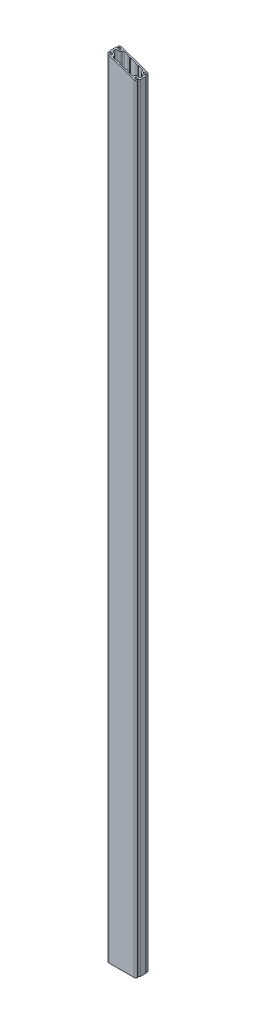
ISO-10303-21;
HEADER;
FILE_DESCRIPTION(('STEP AP214'),'2;1');
FILE_NAME('part.step','',(''),(''),'','','');
FILE_SCHEMA(('AUTOMOTIVE_DESIGN { 1 0 10303 214 1 1 1 1 }'));
ENDSEC;
DATA;
#1=APPLICATION_CONTEXT('core data for automotive mechanical design processes');
#2=APPLICATION_PROTOCOL_DEFINITION('international standard','automotive_design',2000,#1);
#3=PRODUCT_CONTEXT('',#1,'mechanical');
#4=PRODUCT('Part','Part','',(#3));
#5=PRODUCT_RELATED_PRODUCT_CATEGORY('part','',(#4));
#6=PRODUCT_DEFINITION_FORMATION('','',#4);
#7=PRODUCT_DEFINITION_CONTEXT('part definition',#1,'design');
#8=PRODUCT_DEFINITION('design','',#6,#7);
#9=PRODUCT_DEFINITION_SHAPE('','',#8);
#10=(LENGTH_UNIT() NAMED_UNIT(*) SI_UNIT(.MILLI.,.METRE.));
#11=(NAMED_UNIT(*) PLANE_ANGLE_UNIT() SI_UNIT($,.RADIAN.));
#12=(NAMED_UNIT(*) SI_UNIT($,.STERADIAN.) SOLID_ANGLE_UNIT());
#13=UNCERTAINTY_MEASURE_WITH_UNIT(LENGTH_MEASURE(1.E-05),#10,'distance_accuracy_value','');
#14=(GEOMETRIC_REPRESENTATION_CONTEXT(3) GLOBAL_UNCERTAINTY_ASSIGNED_CONTEXT((#13)) GLOBAL_UNIT_ASSIGNED_CONTEXT((#10,
#11,#12)) REPRESENTATION_CONTEXT('',''));
#15=CARTESIAN_POINT('',(0.,0.,0.));
#16=DIRECTION('',(0.,0.,1.));
#17=DIRECTION('',(1.,0.,0.));
#18=AXIS2_PLACEMENT_3D('',#15,#16,#17);
#19=CARTESIAN_POINT('',(84.6938611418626,0.,-30.5717765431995));
#20=DIRECTION('',(0.,1.,0.));
#21=DIRECTION('',(0.,0.,1.));
#22=AXIS2_PLACEMENT_3D('',#19,#20,#21);
#23=PLANE('',#22);
#24=CARTESIAN_POINT('',(84.6938611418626,0.,-30.5717765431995));
#25=DIRECTION('',(0.,1.,0.));
#26=DIRECTION('',(0.,0.,1.));
#27=AXIS2_PLACEMENT_3D('',#24,#25,#26);
#28=CIRCLE('',#27,3.99999999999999);
#29=CARTESIAN_POINT('',(81.1914378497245,0.,-28.6396711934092));
#30=VERTEX_POINT('',#29);
#31=CARTESIAN_POINT('',(88.1962844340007,0.,-32.5038818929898));
#32=VERTEX_POINT('',#31);
#33=EDGE_CURVE('E411',#30,#32,#28,.T.);
#34=ORIENTED_EDGE('',*,*,#33,.F.);
#35=CARTESIAN_POINT('',(75.5,0.,-25.5));
#36=DIRECTION('',(0.,-1.,0.));
#37=DIRECTION('',(0.,0.,1.));
#38=AXIS2_PLACEMENT_3D('',#35,#36,#37);
#39=CIRCLE('',#38,6.5);
#40=CARTESIAN_POINT('',(79.7220192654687,0.,-20.5578796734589));
#41=VERTEX_POINT('',#40);
#42=EDGE_CURVE('E400',#41,#30,#39,.T.);
#43=ORIENTED_EDGE('',*,*,#42,.F.);
#44=CARTESIAN_POINT('',(83.7691890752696,0.,-15.8204308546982));
#45=DIRECTION('',(0.,1.,0.));
#46=DIRECTION('',(0.,0.,1.));
#47=AXIS2_PLACEMENT_3D('',#44,#45,#46);
#48=CIRCLE('',#47,6.23081092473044);
#49=CARTESIAN_POINT('',(90.,0.,-15.8204308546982));
#50=VERTEX_POINT('',#49);
#51=EDGE_CURVE('E405',#50,#41,#48,.T.);
#52=ORIENTED_EDGE('',*,*,#51,.F.);
#53=DIRECTION('',(0.,0.,-1.));
#54=VECTOR('',#53,1.);
#55=CARTESIAN_POINT('',(90.,0.,15.8204308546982));
#56=LINE('',#55,#54);
#57=CARTESIAN_POINT('',(90.,0.,15.8204308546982));
#58=VERTEX_POINT('',#57);
#59=EDGE_CURVE('E459',#58,#50,#56,.T.);
#60=ORIENTED_EDGE('',*,*,#59,.F.);
#61=CARTESIAN_POINT('',(83.7691890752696,0.,15.8204308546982));
#62=DIRECTION('',(0.,1.,0.));
#63=DIRECTION('',(0.,0.,-1.));
#64=AXIS2_PLACEMENT_3D('',#61,#62,#63);
#65=CIRCLE('',#64,6.23081092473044);
#66=CARTESIAN_POINT('',(79.7220192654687,0.,20.5578796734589));
#67=VERTEX_POINT('',#66);
#68=EDGE_CURVE('E456',#67,#58,#65,.T.);
#69=ORIENTED_EDGE('',*,*,#68,.F.);
#70=CARTESIAN_POINT('',(75.5,0.,25.5));
#71=DIRECTION('',(0.,-1.,0.));
#72=DIRECTION('',(0.,0.,-1.));
#73=AXIS2_PLACEMENT_3D('',#70,#71,#72);
#74=CIRCLE('',#73,6.5);
#75=CARTESIAN_POINT('',(81.1914378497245,0.,28.6396711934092));
#76=VERTEX_POINT('',#75);
#77=EDGE_CURVE('E453',#76,#67,#74,.T.);
#78=ORIENTED_EDGE('',*,*,#77,.F.);
#79=CARTESIAN_POINT('',(84.6938611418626,0.,30.5717765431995));
#80=DIRECTION('',(0.,1.,0.));
#81=DIRECTION('',(0.,0.,-1.));
#82=AXIS2_PLACEMENT_3D('',#79,#80,#81);
#83=CIRCLE('',#82,3.99999999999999);
#84=CARTESIAN_POINT('',(88.1962844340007,0.,32.5038818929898));
#85=VERTEX_POINT('',#84);
#86=EDGE_CURVE('E450',#85,#76,#83,.T.);
#87=ORIENTED_EDGE('',*,*,#86,.F.);
#88=CARTESIAN_POINT('',(75.5,0.,25.5));
#89=DIRECTION('',(0.,1.,0.));
#90=DIRECTION('',(0.,0.,-1.));
#91=AXIS2_PLACEMENT_3D('',#88,#89,#90);
#92=CIRCLE('',#91,14.5);
#93=CARTESIAN_POINT('',(75.5,0.,40.));
#94=VERTEX_POINT('',#93);
#95=EDGE_CURVE('E447',#94,#85,#92,.T.);
#96=ORIENTED_EDGE('',*,*,#95,.F.);
#97=DIRECTION('',(1.,0.,0.));
#98=VECTOR('',#97,1.);
#99=CARTESIAN_POINT('',(75.5,0.,40.));
#100=LINE('',#99,#98);
#101=CARTESIAN_POINT('',(-75.5,0.,40.));
#102=VERTEX_POINT('',#101);
#103=EDGE_CURVE('E444',#102,#94,#100,.T.);
#104=ORIENTED_EDGE('',*,*,#103,.F.);
#105=CARTESIAN_POINT('',(-75.5,0.,25.5));
#106=DIRECTION('',(0.,1.,0.));
#107=DIRECTION('',(0.,0.,1.));
#108=AXIS2_PLACEMENT_3D('',#105,#106,#107);
#109=CIRCLE('',#108,14.5);
#110=CARTESIAN_POINT('',(-88.1962844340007,0.,32.5038818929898));
#111=VERTEX_POINT('',#110);
#112=EDGE_CURVE('E441',#111,#102,#109,.T.);
#113=ORIENTED_EDGE('',*,*,#112,.F.);
#114=CARTESIAN_POINT('',(-84.6938611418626,0.,30.5717765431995));
#115=DIRECTION('',(0.,1.,0.));
#116=DIRECTION('',(0.,0.,1.));
#117=AXIS2_PLACEMENT_3D('',#114,#115,#116);
#118=CIRCLE('',#117,3.99999999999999);
#119=CARTESIAN_POINT('',(-81.1914378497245,0.,28.6396711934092));
#120=VERTEX_POINT('',#119);
#121=EDGE_CURVE('E438',#120,#111,#118,.T.);
#122=ORIENTED_EDGE('',*,*,#121,.F.);
#123=CARTESIAN_POINT('',(-75.5,0.,25.5));
#124=DIRECTION('',(0.,-1.,0.));
#125=DIRECTION('',(0.,0.,1.));
#126=AXIS2_PLACEMENT_3D('',#123,#124,#125);
#127=CIRCLE('',#126,6.5);
#128=CARTESIAN_POINT('',(-79.7220192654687,0.,20.5578796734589));
#129=VERTEX_POINT('',#128);
#130=EDGE_CURVE('E435',#129,#120,#127,.T.);
#131=ORIENTED_EDGE('',*,*,#130,.F.);
#132=CARTESIAN_POINT('',(-83.7691890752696,0.,15.8204308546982));
#133=DIRECTION('',(0.,1.,0.));
#134=DIRECTION('',(0.,0.,1.));
#135=AXIS2_PLACEMENT_3D('',#132,#133,#134);
#136=CIRCLE('',#135,6.23081092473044);
#137=CARTESIAN_POINT('',(-90.,0.,15.8204308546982));
#138=VERTEX_POINT('',#137);
#139=EDGE_CURVE('E432',#138,#129,#136,.T.);
#140=ORIENTED_EDGE('',*,*,#139,.F.);
#141=DIRECTION('',(0.,0.,1.));
#142=VECTOR('',#141,1.);
#143=CARTESIAN_POINT('',(-90.,0.,15.8204308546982));
#144=LINE('',#143,#142);
#145=CARTESIAN_POINT('',(-90.,0.,-15.8204308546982));
#146=VERTEX_POINT('',#145);
#147=EDGE_CURVE('E430',#146,#138,#144,.T.);
#148=ORIENTED_EDGE('',*,*,#147,.F.);
#149=CARTESIAN_POINT('',(-83.7691890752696,0.,-15.8204308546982));
#150=DIRECTION('',(0.,1.,0.));
#151=DIRECTION('',(0.,0.,-1.));
#152=AXIS2_PLACEMENT_3D('',#149,#150,#151);
#153=CIRCLE('',#152,6.23081092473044);
#154=CARTESIAN_POINT('',(-79.7220192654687,0.,-20.5578796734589));
#155=VERTEX_POINT('',#154);
#156=EDGE_CURVE('E390',#155,#146,#153,.T.);
#157=ORIENTED_EDGE('',*,*,#156,.F.);
#158=CARTESIAN_POINT('',(-75.5,0.,-25.5));
#159=DIRECTION('',(0.,-1.,0.));
#160=DIRECTION('',(0.,0.,-1.));
#161=AXIS2_PLACEMENT_3D('',#158,#159,#160);
#162=CIRCLE('',#161,6.5);
#163=CARTESIAN_POINT('',(-81.1914378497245,0.,-28.6396711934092));
#164=VERTEX_POINT('',#163);
#165=EDGE_CURVE('E426',#164,#155,#162,.T.);
#166=ORIENTED_EDGE('',*,*,#165,.F.);
#167=CARTESIAN_POINT('',(-84.6938611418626,0.,-30.5717765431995));
#168=DIRECTION('',(0.,1.,0.));
#169=DIRECTION('',(0.,0.,-1.));
#170=AXIS2_PLACEMENT_3D('',#167,#168,#169);
#171=CIRCLE('',#170,3.99999999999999);
#172=CARTESIAN_POINT('',(-88.1962844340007,0.,-32.5038818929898));
#173=VERTEX_POINT('',#172);
#174=EDGE_CURVE('E423',#173,#164,#171,.T.);
#175=ORIENTED_EDGE('',*,*,#174,.F.);
#176=CARTESIAN_POINT('',(-75.5,0.,-25.5));
#177=DIRECTION('',(0.,1.,0.));
#178=DIRECTION('',(0.,0.,-1.));
#179=AXIS2_PLACEMENT_3D('',#176,#177,#178);
#180=CIRCLE('',#179,14.5);
#181=CARTESIAN_POINT('',(-75.5,0.,-40.));
#182=VERTEX_POINT('',#181);
#183=EDGE_CURVE('E420',#182,#173,#180,.T.);
#184=ORIENTED_EDGE('',*,*,#183,.F.);
#185=DIRECTION('',(-1.,0.,0.));
#186=VECTOR('',#185,1.);
#187=CARTESIAN_POINT('',(75.5,0.,-40.));
#188=LINE('',#187,#186);
#189=CARTESIAN_POINT('',(75.5,0.,-40.));
#190=VERTEX_POINT('',#189);
#191=EDGE_CURVE('E417',#190,#182,#188,.T.);
#192=ORIENTED_EDGE('',*,*,#191,.F.);
#193=CARTESIAN_POINT('',(75.5,0.,-25.5));
#194=DIRECTION('',(0.,1.,0.));
#195=DIRECTION('',(0.,0.,1.));
#196=AXIS2_PLACEMENT_3D('',#193,#194,#195);
#197=CIRCLE('',#196,14.5);
#198=EDGE_CURVE('E414',#32,#190,#197,.T.);
#199=ORIENTED_EDGE('',*,*,#198,.F.);
#200=EDGE_LOOP('',(#34,#43,#52,#60,#69,#78,#87,#96,#104,#113,#122,#131,#140,#148,#157,#166,#175,
#184,#192,#199));
#201=FACE_BOUND('',#200,.T.);
#202=CARTESIAN_POINT('',(75.5,0.,-25.5));
#203=DIRECTION('',(0.,-1.,0.));
#204=DIRECTION('',(0.,0.,1.));
#205=AXIS2_PLACEMENT_3D('',#202,#203,#204);
#206=CIRCLE('',#205,14.5);
#207=CARTESIAN_POINT('',(75.5,0.,-11.));
#208=VERTEX_POINT('',#207);
#209=CARTESIAN_POINT('',(61.,0.,-25.5));
#210=VERTEX_POINT('',#209);
#211=EDGE_CURVE('E584',#208,#210,#206,.T.);
#212=ORIENTED_EDGE('',*,*,#211,.T.);
#213=CARTESIAN_POINT('',(54.5,0.,-25.5));
#214=DIRECTION('',(0.,1.,0.));
#215=DIRECTION('',(0.,0.,1.));
#216=AXIS2_PLACEMENT_3D('',#213,#214,#215);
#217=CIRCLE('',#216,6.5);
#218=CARTESIAN_POINT('',(54.5,0.,-32.));
#219=VERTEX_POINT('',#218);
#220=EDGE_CURVE('E587',#210,#219,#217,.T.);
#221=ORIENTED_EDGE('',*,*,#220,.T.);
#222=DIRECTION('',(-1.,0.,0.));
#223=VECTOR('',#222,1.);
#224=CARTESIAN_POINT('',(32.5172988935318,0.,-32.));
#225=LINE('',#224,#223);
#226=CARTESIAN_POINT('',(32.5172988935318,0.,-32.));
#227=VERTEX_POINT('',#226);
#228=EDGE_CURVE('E590',#219,#227,#225,.T.);
#229=ORIENTED_EDGE('',*,*,#228,.T.);
#230=DIRECTION('',(-0.642787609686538,0.,0.766044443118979));
#231=VECTOR('',#230,1.);
#232=CARTESIAN_POINT('',(30.,0.,-29.));
#233=LINE('',#232,#231);
#234=CARTESIAN_POINT('',(30.,0.,-29.));
#235=VERTEX_POINT('',#234);
#236=EDGE_CURVE('E593',#227,#235,#233,.T.);
#237=ORIENTED_EDGE('',*,*,#236,.T.);
#238=DIRECTION('',(-1.,0.,0.));
#239=VECTOR('',#238,1.);
#240=CARTESIAN_POINT('',(20.,0.,-29.));
#241=LINE('',#240,#239);
#242=CARTESIAN_POINT('',(20.,0.,-29.));
#243=VERTEX_POINT('',#242);
#244=EDGE_CURVE('E596',#235,#243,#241,.T.);
#245=ORIENTED_EDGE('',*,*,#244,.T.);
#246=DIRECTION('',(-0.642787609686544,0.,-0.766044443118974));
#247=VECTOR('',#246,1.);
#248=CARTESIAN_POINT('',(20.,0.,-29.));
#249=LINE('',#248,#247);
#250=CARTESIAN_POINT('',(17.4827011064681,0.,-32.));
#251=VERTEX_POINT('',#250);
#252=EDGE_CURVE('E599',#243,#251,#249,.T.);
#253=ORIENTED_EDGE('',*,*,#252,.T.);
#254=DIRECTION('',(-1.,0.,0.));
#255=VECTOR('',#254,1.);
#256=CARTESIAN_POINT('',(-17.4827011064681,0.,-32.));
#257=LINE('',#256,#255);
#258=CARTESIAN_POINT('',(-17.4827011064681,0.,-32.));
#259=VERTEX_POINT('',#258);
#260=EDGE_CURVE('E602',#251,#259,#257,.T.);
#261=ORIENTED_EDGE('',*,*,#260,.T.);
#262=DIRECTION('',(-0.642787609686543,0.,0.766044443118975));
#263=VECTOR('',#262,1.);
#264=CARTESIAN_POINT('',(-20.,0.,-29.));
#265=LINE('',#264,#263);
#266=CARTESIAN_POINT('',(-20.,0.,-29.));
#267=VERTEX_POINT('',#266);
#268=EDGE_CURVE('E605',#259,#267,#265,.T.);
#269=ORIENTED_EDGE('',*,*,#268,.T.);
#270=DIRECTION('',(-1.,0.,0.));
#271=VECTOR('',#270,1.);
#272=CARTESIAN_POINT('',(-20.,0.,-29.));
#273=LINE('',#272,#271);
#274=CARTESIAN_POINT('',(-30.,0.,-29.));
#275=VERTEX_POINT('',#274);
#276=EDGE_CURVE('E608',#267,#275,#273,.T.);
#277=ORIENTED_EDGE('',*,*,#276,.T.);
#278=DIRECTION('',(-0.642787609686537,0.,-0.76604444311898));
#279=VECTOR('',#278,1.);
#280=CARTESIAN_POINT('',(-30.,0.,-29.));
#281=LINE('',#280,#279);
#282=CARTESIAN_POINT('',(-32.5172988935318,0.,-32.));
#283=VERTEX_POINT('',#282);
#284=EDGE_CURVE('E611',#275,#283,#281,.T.);
#285=ORIENTED_EDGE('',*,*,#284,.T.);
#286=DIRECTION('',(-1.,0.,0.));
#287=VECTOR('',#286,1.);
#288=CARTESIAN_POINT('',(-32.5172988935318,0.,-32.));
#289=LINE('',#288,#287);
#290=CARTESIAN_POINT('',(-54.5,0.,-32.));
#291=VERTEX_POINT('',#290);
#292=EDGE_CURVE('E614',#283,#291,#289,.T.);
#293=ORIENTED_EDGE('',*,*,#292,.T.);
#294=CARTESIAN_POINT('',(-54.5,0.,-25.5));
#295=DIRECTION('',(0.,1.,0.));
#296=DIRECTION('',(0.,0.,-1.));
#297=AXIS2_PLACEMENT_3D('',#294,#295,#296);
#298=CIRCLE('',#297,6.5);
#299=CARTESIAN_POINT('',(-61.,0.,-25.5));
#300=VERTEX_POINT('',#299);
#301=EDGE_CURVE('E617',#291,#300,#298,.T.);
#302=ORIENTED_EDGE('',*,*,#301,.T.);
#303=CARTESIAN_POINT('',(-75.5,0.,-25.5));
#304=DIRECTION('',(0.,-1.,0.));
#305=DIRECTION('',(0.,0.,-1.));
#306=AXIS2_PLACEMENT_3D('',#303,#304,#305);
#307=CIRCLE('',#306,14.5);
#308=CARTESIAN_POINT('',(-75.5,0.,-11.));
#309=VERTEX_POINT('',#308);
#310=EDGE_CURVE('E620',#300,#309,#307,.T.);
#311=ORIENTED_EDGE('',*,*,#310,.T.);
#312=CARTESIAN_POINT('',(-75.5,0.,-4.5));
#313=DIRECTION('',(0.,1.,0.));
#314=DIRECTION('',(0.,0.,-1.));
#315=AXIS2_PLACEMENT_3D('',#312,#313,#314);
#316=CIRCLE('',#315,6.5);
#317=CARTESIAN_POINT('',(-82.,0.,-4.5));
#318=VERTEX_POINT('',#317);
#319=EDGE_CURVE('E623',#309,#318,#316,.T.);
#320=ORIENTED_EDGE('',*,*,#319,.T.);
#321=DIRECTION('',(0.,0.,1.));
#322=VECTOR('',#321,1.);
#323=CARTESIAN_POINT('',(-82.,0.,-4.5));
#324=LINE('',#323,#322);
#325=CARTESIAN_POINT('',(-82.,0.,4.5));
#326=VERTEX_POINT('',#325);
#327=EDGE_CURVE('E626',#318,#326,#324,.T.);
#328=ORIENTED_EDGE('',*,*,#327,.T.);
#329=CARTESIAN_POINT('',(-75.5,0.,4.5));
#330=DIRECTION('',(0.,1.,0.));
#331=DIRECTION('',(0.,0.,1.));
#332=AXIS2_PLACEMENT_3D('',#329,#330,#331);
#333=CIRCLE('',#332,6.5);
#334=CARTESIAN_POINT('',(-75.5,0.,11.));
#335=VERTEX_POINT('',#334);
#336=EDGE_CURVE('E629',#326,#335,#333,.T.);
#337=ORIENTED_EDGE('',*,*,#336,.T.);
#338=CARTESIAN_POINT('',(-75.5,0.,25.5));
#339=DIRECTION('',(0.,-1.,0.));
#340=DIRECTION('',(0.,0.,1.));
#341=AXIS2_PLACEMENT_3D('',#338,#339,#340);
#342=CIRCLE('',#341,14.5);
#343=CARTESIAN_POINT('',(-61.,0.,25.5));
#344=VERTEX_POINT('',#343);
#345=EDGE_CURVE('E632',#335,#344,#342,.T.);
#346=ORIENTED_EDGE('',*,*,#345,.T.);
#347=CARTESIAN_POINT('',(-54.5,0.,25.5));
#348=DIRECTION('',(0.,1.,0.));
#349=DIRECTION('',(0.,0.,1.));
#350=AXIS2_PLACEMENT_3D('',#347,#348,#349);
#351=CIRCLE('',#350,6.5);
#352=CARTESIAN_POINT('',(-54.5,0.,32.));
#353=VERTEX_POINT('',#352);
#354=EDGE_CURVE('E635',#344,#353,#351,.T.);
#355=ORIENTED_EDGE('',*,*,#354,.T.);
#356=DIRECTION('',(1.,0.,0.));
#357=VECTOR('',#356,1.);
#358=CARTESIAN_POINT('',(-32.5172988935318,0.,32.));
#359=LINE('',#358,#357);
#360=CARTESIAN_POINT('',(-32.5172988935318,0.,32.));
#361=VERTEX_POINT('',#360);
#362=EDGE_CURVE('E638',#353,#361,#359,.T.);
#363=ORIENTED_EDGE('',*,*,#362,.T.);
#364=DIRECTION('',(0.642787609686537,0.,-0.76604444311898));
#365=VECTOR('',#364,1.);
#366=CARTESIAN_POINT('',(-30.,0.,29.));
#367=LINE('',#366,#365);
#368=CARTESIAN_POINT('',(-30.,0.,29.));
#369=VERTEX_POINT('',#368);
#370=EDGE_CURVE('E641',#361,#369,#367,.T.);
#371=ORIENTED_EDGE('',*,*,#370,.T.);
#372=DIRECTION('',(1.,0.,0.));
#373=VECTOR('',#372,1.);
#374=CARTESIAN_POINT('',(-20.,0.,29.));
#375=LINE('',#374,#373);
#376=CARTESIAN_POINT('',(-20.,0.,29.));
#377=VERTEX_POINT('',#376);
#378=EDGE_CURVE('E644',#369,#377,#375,.T.);
#379=ORIENTED_EDGE('',*,*,#378,.T.);
#380=DIRECTION('',(0.642787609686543,0.,0.766044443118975));
#381=VECTOR('',#380,1.);
#382=CARTESIAN_POINT('',(-20.,0.,29.));
#383=LINE('',#382,#381);
#384=CARTESIAN_POINT('',(-17.4827011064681,0.,32.));
#385=VERTEX_POINT('',#384);
#386=EDGE_CURVE('E647',#377,#385,#383,.T.);
#387=ORIENTED_EDGE('',*,*,#386,.T.);
#388=DIRECTION('',(1.,0.,0.));
#389=VECTOR('',#388,1.);
#390=CARTESIAN_POINT('',(-17.4827011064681,0.,32.));
#391=LINE('',#390,#389);
#392=CARTESIAN_POINT('',(17.4827011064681,0.,32.));
#393=VERTEX_POINT('',#392);
#394=EDGE_CURVE('E650',#385,#393,#391,.T.);
#395=ORIENTED_EDGE('',*,*,#394,.T.);
#396=DIRECTION('',(0.642787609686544,0.,-0.766044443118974));
#397=VECTOR('',#396,1.);
#398=CARTESIAN_POINT('',(20.,0.,29.));
#399=LINE('',#398,#397);
#400=CARTESIAN_POINT('',(20.,0.,29.));
#401=VERTEX_POINT('',#400);
#402=EDGE_CURVE('E653',#393,#401,#399,.T.);
#403=ORIENTED_EDGE('',*,*,#402,.T.);
#404=DIRECTION('',(1.,0.,0.));
#405=VECTOR('',#404,1.);
#406=CARTESIAN_POINT('',(20.,0.,29.));
#407=LINE('',#406,#405);
#408=CARTESIAN_POINT('',(30.,0.,29.));
#409=VERTEX_POINT('',#408);
#410=EDGE_CURVE('E656',#401,#409,#407,.T.);
#411=ORIENTED_EDGE('',*,*,#410,.T.);
#412=DIRECTION('',(0.642787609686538,0.,0.766044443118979));
#413=VECTOR('',#412,1.);
#414=CARTESIAN_POINT('',(30.,0.,29.));
#415=LINE('',#414,#413);
#416=CARTESIAN_POINT('',(32.5172988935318,0.,32.));
#417=VERTEX_POINT('',#416);
#418=EDGE_CURVE('E659',#409,#417,#415,.T.);
#419=ORIENTED_EDGE('',*,*,#418,.T.);
#420=DIRECTION('',(1.,0.,0.));
#421=VECTOR('',#420,1.);
#422=CARTESIAN_POINT('',(32.5172988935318,0.,32.));
#423=LINE('',#422,#421);
#424=CARTESIAN_POINT('',(54.5,0.,32.));
#425=VERTEX_POINT('',#424);
#426=EDGE_CURVE('E662',#417,#425,#423,.T.);
#427=ORIENTED_EDGE('',*,*,#426,.T.);
#428=CARTESIAN_POINT('',(54.5,0.,25.5));
#429=DIRECTION('',(0.,1.,0.));
#430=DIRECTION('',(0.,0.,-1.));
#431=AXIS2_PLACEMENT_3D('',#428,#429,#430);
#432=CIRCLE('',#431,6.5);
#433=CARTESIAN_POINT('',(61.,0.,25.5));
#434=VERTEX_POINT('',#433);
#435=EDGE_CURVE('E665',#425,#434,#432,.T.);
#436=ORIENTED_EDGE('',*,*,#435,.T.);
#437=CARTESIAN_POINT('',(75.5,0.,25.5));
#438=DIRECTION('',(0.,-1.,0.));
#439=DIRECTION('',(0.,0.,-1.));
#440=AXIS2_PLACEMENT_3D('',#437,#438,#439);
#441=CIRCLE('',#440,14.5);
#442=CARTESIAN_POINT('',(75.5,0.,11.));
#443=VERTEX_POINT('',#442);
#444=EDGE_CURVE('E668',#434,#443,#441,.T.);
#445=ORIENTED_EDGE('',*,*,#444,.T.);
#446=CARTESIAN_POINT('',(75.5,0.,4.5));
#447=DIRECTION('',(0.,1.,0.));
#448=DIRECTION('',(0.,0.,-1.));
#449=AXIS2_PLACEMENT_3D('',#446,#447,#448);
#450=CIRCLE('',#449,6.5);
#451=CARTESIAN_POINT('',(82.,0.,4.5));
#452=VERTEX_POINT('',#451);
#453=EDGE_CURVE('E671',#443,#452,#450,.T.);
#454=ORIENTED_EDGE('',*,*,#453,.T.);
#455=DIRECTION('',(0.,0.,-1.));
#456=VECTOR('',#455,1.);
#457=CARTESIAN_POINT('',(82.,0.,-4.5));
#458=LINE('',#457,#456);
#459=CARTESIAN_POINT('',(82.,0.,-4.5));
#460=VERTEX_POINT('',#459);
#461=EDGE_CURVE('E674',#452,#460,#458,.T.);
#462=ORIENTED_EDGE('',*,*,#461,.T.);
#463=CARTESIAN_POINT('',(75.5,0.,-4.5));
#464=DIRECTION('',(0.,1.,0.));
#465=DIRECTION('',(0.,0.,1.));
#466=AXIS2_PLACEMENT_3D('',#463,#464,#465);
#467=CIRCLE('',#466,6.5);
#468=EDGE_CURVE('E677',#460,#208,#467,.T.);
#469=ORIENTED_EDGE('',*,*,#468,.T.);
#470=EDGE_LOOP('',(#212,#221,#229,#237,#245,#253,#261,#269,#277,#285,#293,#302,#311,#320,#328,
#337,#346,#355,#363,#371,#379,#387,#395,#403,#411,#419,#427,#436,#445,#454,#462,#469));
#471=FACE_BOUND('',#470,.T.);
#472=ADVANCED_FACE('F48',(#201,#471),#23,.F.);
#473=CARTESIAN_POINT('',(84.6938611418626,4733.,-30.5717765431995));
#474=DIRECTION('',(0.,-1.,0.));
#475=DIRECTION('',(0.,0.,-1.));
#476=AXIS2_PLACEMENT_3D('',#473,#474,#475);
#477=CYLINDRICAL_SURFACE('',#476,3.99999999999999);
#478=DIRECTION('',(0.,-1.,0.));
#479=VECTOR('',#478,1.);
#480=CARTESIAN_POINT('',(88.1962844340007,4733.,-32.5038818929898));
#481=LINE('',#480,#479);
#482=CARTESIAN_POINT('',(88.1962844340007,4671.22528816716,-32.5038818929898));
#483=VERTEX_POINT('',#482);
#484=EDGE_CURVE('E56',#483,#32,#481,.T.);
#485=ORIENTED_EDGE('',*,*,#484,.F.);
#486=CARTESIAN_POINT('',(84.6938611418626,4672.43946157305,-30.5717765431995));
#487=DIRECTION('',(-0.327543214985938,-0.944836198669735,0.));
#488=DIRECTION('',(0.944836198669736,-0.327543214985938,0.));
#489=AXIS2_PLACEMENT_3D('',#486,#487,#488);
#490=ELLIPSE('',#489,4.23353805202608,3.99999999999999);
#491=CARTESIAN_POINT('',(81.1914378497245,4673.65363497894,-28.6396711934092));
#492=VERTEX_POINT('',#491);
#493=EDGE_CURVE('E510',#483,#492,#490,.T.);
#494=ORIENTED_EDGE('',*,*,#493,.T.);
#495=DIRECTION('',(0.,-1.,0.));
#496=VECTOR('',#495,1.);
#497=CARTESIAN_POINT('',(81.1914378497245,4733.,-28.6396711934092));
#498=LINE('',#497,#496);
#499=EDGE_CURVE('E399',#492,#30,#498,.T.);
#500=ORIENTED_EDGE('',*,*,#499,.T.);
#501=ORIENTED_EDGE('',*,*,#33,.T.);
#502=EDGE_LOOP('',(#485,#494,#500,#501));
#503=FACE_BOUND('',#502,.T.);
#504=ADVANCED_FACE('F50',(#503),#477,.T.);
#505=CARTESIAN_POINT('',(75.5,4733.,-25.5));
#506=DIRECTION('',(0.,-1.,0.));
#507=DIRECTION('',(0.,0.,-1.));
#508=AXIS2_PLACEMENT_3D('',#505,#506,#507);
#509=CYLINDRICAL_SURFACE('',#508,14.5);
#510=DIRECTION('',(0.,-1.,0.));
#511=VECTOR('',#510,1.);
#512=CARTESIAN_POINT('',(75.5,4733.,-40.));
#513=LINE('',#512,#511);
#514=CARTESIAN_POINT('',(75.4999999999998,4675.62666676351,-40.));
#515=VERTEX_POINT('',#514);
#516=EDGE_CURVE('E493',#515,#190,#513,.T.);
#517=ORIENTED_EDGE('',*,*,#516,.F.);
#518=CARTESIAN_POINT('',(75.5,4675.62666676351,-25.5));
#519=DIRECTION('',(-0.327543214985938,-0.944836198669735,0.));
#520=DIRECTION('',(0.944836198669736,-0.327543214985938,0.));
#521=AXIS2_PLACEMENT_3D('',#518,#519,#520);
#522=ELLIPSE('',#521,15.3465754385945,14.5);
#523=EDGE_CURVE('E501',#515,#483,#522,.T.);
#524=ORIENTED_EDGE('',*,*,#523,.T.);
#525=ORIENTED_EDGE('',*,*,#484,.T.);
#526=ORIENTED_EDGE('',*,*,#198,.T.);
#527=EDGE_LOOP('',(#517,#524,#525,#526));
#528=FACE_BOUND('',#527,.T.);
#529=ADVANCED_FACE('F499',(#528),#509,.T.);
#530=CARTESIAN_POINT('',(75.5,4733.,-40.));
#531=DIRECTION('',(0.,0.,1.));
#532=DIRECTION('',(1.,0.,0.));
#533=AXIS2_PLACEMENT_3D('',#530,#531,#532);
#534=PLANE('',#533);
#535=DIRECTION('',(0.,-1.,0.));
#536=VECTOR('',#535,1.);
#537=CARTESIAN_POINT('',(-75.5,4733.,-40.));
#538=LINE('',#537,#536);
#539=CARTESIAN_POINT('',(-75.5,4727.97333334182,-40.));
#540=VERTEX_POINT('',#539);
#541=EDGE_CURVE('E491',#540,#182,#538,.T.);
#542=ORIENTED_EDGE('',*,*,#541,.F.);
#543=DIRECTION('',(0.944836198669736,-0.327543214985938,0.));
#544=VECTOR('',#543,1.);
#545=CARTESIAN_POINT('',(90.0000000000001,4670.60000010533,-40.));
#546=LINE('',#545,#544);
#547=EDGE_CURVE('E766',#540,#515,#546,.T.);
#548=ORIENTED_EDGE('',*,*,#547,.T.);
#549=ORIENTED_EDGE('',*,*,#516,.T.);
#550=ORIENTED_EDGE('',*,*,#191,.T.);
#551=EDGE_LOOP('',(#542,#548,#549,#550));
#552=FACE_BOUND('',#551,.T.);
#553=ADVANCED_FACE('F841',(#552),#534,.F.);
#554=CARTESIAN_POINT('',(-75.5,4733.,-25.5));
#555=DIRECTION('',(0.,-1.,0.));
#556=DIRECTION('',(0.,0.,-1.));
#557=AXIS2_PLACEMENT_3D('',#554,#555,#556);
#558=CYLINDRICAL_SURFACE('',#557,14.5);
#559=DIRECTION('',(0.,-1.,0.));
#560=VECTOR('',#559,1.);
#561=CARTESIAN_POINT('',(-88.1962844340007,4733.,-32.5038818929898));
#562=LINE('',#561,#560);
#563=CARTESIAN_POINT('',(-88.1962844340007,4732.37471193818,-32.5038818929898));
#564=VERTEX_POINT('',#563);
#565=EDGE_CURVE('E489',#564,#173,#562,.T.);
#566=ORIENTED_EDGE('',*,*,#565,.F.);
#567=CARTESIAN_POINT('',(-75.5,4727.97333334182,-25.5));
#568=DIRECTION('',(-0.327543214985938,-0.944836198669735,0.));
#569=DIRECTION('',(0.944836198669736,-0.327543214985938,0.));
#570=AXIS2_PLACEMENT_3D('',#567,#568,#569);
#571=ELLIPSE('',#570,15.3465754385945,14.5);
#572=EDGE_CURVE('E581',#564,#540,#571,.T.);
#573=ORIENTED_EDGE('',*,*,#572,.T.);
#574=ORIENTED_EDGE('',*,*,#541,.T.);
#575=ORIENTED_EDGE('',*,*,#183,.T.);
#576=EDGE_LOOP('',(#566,#573,#574,#575));
#577=FACE_BOUND('',#576,.T.);
#578=ADVANCED_FACE('F844',(#577),#558,.T.);
#579=CARTESIAN_POINT('',(-84.6938611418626,4733.,-30.5717765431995));
#580=DIRECTION('',(0.,-1.,0.));
#581=DIRECTION('',(0.,0.,-1.));
#582=AXIS2_PLACEMENT_3D('',#579,#580,#581);
#583=CYLINDRICAL_SURFACE('',#582,3.99999999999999);
#584=DIRECTION('',(0.,-1.,0.));
#585=VECTOR('',#584,1.);
#586=CARTESIAN_POINT('',(-81.1914378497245,4733.,-28.6396711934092));
#587=LINE('',#586,#585);
#588=CARTESIAN_POINT('',(-81.1914378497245,4729.94636512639,-28.6396711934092));
#589=VERTEX_POINT('',#588);
#590=EDGE_CURVE('E487',#589,#164,#587,.T.);
#591=ORIENTED_EDGE('',*,*,#590,.F.);
#592=CARTESIAN_POINT('',(-84.6938611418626,4731.16053853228,-30.5717765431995));
#593=DIRECTION('',(-0.327543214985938,-0.944836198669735,0.));
#594=DIRECTION('',(0.944836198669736,-0.327543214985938,0.));
#595=AXIS2_PLACEMENT_3D('',#592,#593,#594);
#596=ELLIPSE('',#595,4.23353805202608,3.99999999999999);
#597=EDGE_CURVE('E578',#589,#564,#596,.T.);
#598=ORIENTED_EDGE('',*,*,#597,.T.);
#599=ORIENTED_EDGE('',*,*,#565,.T.);
#600=ORIENTED_EDGE('',*,*,#174,.T.);
#601=EDGE_LOOP('',(#591,#598,#599,#600));
#602=FACE_BOUND('',#601,.T.);
#603=ADVANCED_FACE('F848',(#602),#583,.T.);
#604=CARTESIAN_POINT('',(-75.5,4733.,-25.5));
#605=DIRECTION('',(0.,-1.,0.));
#606=DIRECTION('',(0.,0.,-1.));
#607=AXIS2_PLACEMENT_3D('',#604,#605,#606);
#608=CYLINDRICAL_SURFACE('',#607,6.5);
#609=DIRECTION('',(0.,-1.,0.));
#610=VECTOR('',#609,1.);
#611=CARTESIAN_POINT('',(-79.7220192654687,4733.,-20.5578796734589));
#612=LINE('',#611,#610);
#613=CARTESIAN_POINT('',(-79.7220192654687,4729.43696668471,-20.5578796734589));
#614=VERTEX_POINT('',#613);
#615=EDGE_CURVE('E393',#614,#155,#612,.T.);
#616=ORIENTED_EDGE('',*,*,#615,.F.);
#617=CARTESIAN_POINT('',(-75.5,4727.97333334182,-25.5));
#618=DIRECTION('',(-0.327543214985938,-0.944836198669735,0.));
#619=DIRECTION('',(0.944836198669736,-0.327543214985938,0.));
#620=AXIS2_PLACEMENT_3D('',#617,#618,#619);
#621=ELLIPSE('',#620,6.87949933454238,6.5);
#622=EDGE_CURVE('E381',#614,#589,#621,.F.);
#623=ORIENTED_EDGE('',*,*,#622,.T.);
#624=ORIENTED_EDGE('',*,*,#590,.T.);
#625=ORIENTED_EDGE('',*,*,#165,.T.);
#626=EDGE_LOOP('',(#616,#623,#624,#625));
#627=FACE_BOUND('',#626,.T.);
#628=ADVANCED_FACE('F851',(#627),#608,.F.);
#629=CARTESIAN_POINT('',(-83.7691890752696,4733.,-15.8204308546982));
#630=DIRECTION('',(0.,-1.,0.));
#631=DIRECTION('',(0.,0.,-1.));
#632=AXIS2_PLACEMENT_3D('',#629,#630,#631);
#633=CYLINDRICAL_SURFACE('',#632,6.23081092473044);
#634=DIRECTION('',(0.,-1.,0.));
#635=VECTOR('',#634,1.);
#636=CARTESIAN_POINT('',(-90.,4733.,-15.8204308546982));
#637=LINE('',#636,#635);
#638=CARTESIAN_POINT('',(-90.,4733.,-15.8204308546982));
#639=VERTEX_POINT('',#638);
#640=EDGE_CURVE('E387',#639,#146,#637,.T.);
#641=ORIENTED_EDGE('',*,*,#640,.F.);
#642=CARTESIAN_POINT('',(-83.7691890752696,4730.83998554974,-15.8204308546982));
#643=DIRECTION('',(-0.327543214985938,-0.944836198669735,0.));
#644=DIRECTION('',(0.944836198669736,-0.327543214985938,0.));
#645=AXIS2_PLACEMENT_3D('',#642,#643,#644);
#646=ELLIPSE('',#645,6.59459378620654,6.23081092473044);
#647=EDGE_CURVE('E374',#639,#614,#646,.T.);
#648=ORIENTED_EDGE('',*,*,#647,.T.);
#649=ORIENTED_EDGE('',*,*,#615,.T.);
#650=ORIENTED_EDGE('',*,*,#156,.T.);
#651=EDGE_LOOP('',(#641,#648,#649,#650));
#652=FACE_BOUND('',#651,.T.);
#653=ADVANCED_FACE('F388',(#652),#633,.T.);
#654=CARTESIAN_POINT('',(-90.,4733.,15.8204308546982));
#655=DIRECTION('',(1.,0.,0.));
#656=DIRECTION('',(0.,0.,-1.));
#657=AXIS2_PLACEMENT_3D('',#654,#655,#656);
#658=PLANE('',#657);
#659=ORIENTED_EDGE('',*,*,#147,.T.);
#660=DIRECTION('',(0.,-1.,0.));
#661=VECTOR('',#660,1.);
#662=CARTESIAN_POINT('',(-90.,4733.,15.8204308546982));
#663=LINE('',#662,#661);
#664=CARTESIAN_POINT('',(-90.,4733.,15.8204308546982));
#665=VERTEX_POINT('',#664);
#666=EDGE_CURVE('E394',#665,#138,#663,.T.);
#667=ORIENTED_EDGE('',*,*,#666,.F.);
#668=DIRECTION('',(0.,0.,1.));
#669=VECTOR('',#668,1.);
#670=CARTESIAN_POINT('',(-90.,4733.,15.8204308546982));
#671=LINE('',#670,#669);
#672=EDGE_CURVE('E378',#639,#665,#671,.T.);
#673=ORIENTED_EDGE('',*,*,#672,.F.);
#674=ORIENTED_EDGE('',*,*,#640,.T.);
#675=EDGE_LOOP('',(#659,#667,#673,#674));
#676=FACE_BOUND('',#675,.T.);
#677=ADVANCED_FACE('F397',(#676),#658,.F.);
#678=CARTESIAN_POINT('',(-83.7691890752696,4733.,15.8204308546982));
#679=DIRECTION('',(0.,-1.,0.));
#680=DIRECTION('',(0.,0.,-1.));
#681=AXIS2_PLACEMENT_3D('',#678,#679,#680);
#682=CYLINDRICAL_SURFACE('',#681,6.23081092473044);
#683=DIRECTION('',(0.,-1.,0.));
#684=VECTOR('',#683,1.);
#685=CARTESIAN_POINT('',(-79.7220192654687,4733.,20.5578796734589));
#686=LINE('',#685,#684);
#687=CARTESIAN_POINT('',(-79.7220192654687,4729.43696668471,20.5578796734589));
#688=VERTEX_POINT('',#687);
#689=EDGE_CURVE('E483',#688,#129,#686,.T.);
#690=ORIENTED_EDGE('',*,*,#689,.F.);
#691=CARTESIAN_POINT('',(-83.7691890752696,4730.83998554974,15.8204308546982));
#692=DIRECTION('',(-0.327543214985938,-0.944836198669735,0.));
#693=DIRECTION('',(0.944836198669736,-0.327543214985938,0.));
#694=AXIS2_PLACEMENT_3D('',#691,#692,#693);
#695=ELLIPSE('',#694,6.59459378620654,6.23081092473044);
#696=EDGE_CURVE('E384',#688,#665,#695,.T.);
#697=ORIENTED_EDGE('',*,*,#696,.T.);
#698=ORIENTED_EDGE('',*,*,#666,.T.);
#699=ORIENTED_EDGE('',*,*,#139,.T.);
#700=EDGE_LOOP('',(#690,#697,#698,#699));
#701=FACE_BOUND('',#700,.T.);
#702=ADVANCED_FACE('F571',(#701),#682,.T.);
#703=CARTESIAN_POINT('',(-75.5,4733.,25.5));
#704=DIRECTION('',(0.,-1.,0.));
#705=DIRECTION('',(0.,0.,-1.));
#706=AXIS2_PLACEMENT_3D('',#703,#704,#705);
#707=CYLINDRICAL_SURFACE('',#706,6.5);
#708=DIRECTION('',(0.,-1.,0.));
#709=VECTOR('',#708,1.);
#710=CARTESIAN_POINT('',(-81.1914378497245,4733.,28.6396711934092));
#711=LINE('',#710,#709);
#712=CARTESIAN_POINT('',(-81.1914378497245,4729.94636512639,28.6396711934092));
#713=VERTEX_POINT('',#712);
#714=EDGE_CURVE('E481',#713,#120,#711,.T.);
#715=ORIENTED_EDGE('',*,*,#714,.F.);
#716=CARTESIAN_POINT('',(-75.5,4727.97333334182,25.5));
#717=DIRECTION('',(-0.327543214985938,-0.944836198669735,0.));
#718=DIRECTION('',(0.944836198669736,-0.327543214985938,0.));
#719=AXIS2_PLACEMENT_3D('',#716,#717,#718);
#720=ELLIPSE('',#719,6.87949933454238,6.5);
#721=EDGE_CURVE('E569',#713,#688,#720,.F.);
#722=ORIENTED_EDGE('',*,*,#721,.T.);
#723=ORIENTED_EDGE('',*,*,#689,.T.);
#724=ORIENTED_EDGE('',*,*,#130,.T.);
#725=EDGE_LOOP('',(#715,#722,#723,#724));
#726=FACE_BOUND('',#725,.T.);
#727=ADVANCED_FACE('F566',(#726),#707,.F.);
#728=CARTESIAN_POINT('',(-84.6938611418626,4733.,30.5717765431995));
#729=DIRECTION('',(0.,-1.,0.));
#730=DIRECTION('',(0.,0.,-1.));
#731=AXIS2_PLACEMENT_3D('',#728,#729,#730);
#732=CYLINDRICAL_SURFACE('',#731,3.99999999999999);
#733=DIRECTION('',(0.,-1.,0.));
#734=VECTOR('',#733,1.);
#735=CARTESIAN_POINT('',(-88.1962844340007,4733.,32.5038818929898));
#736=LINE('',#735,#734);
#737=CARTESIAN_POINT('',(-88.1962844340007,4732.37471193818,32.5038818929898));
#738=VERTEX_POINT('',#737);
#739=EDGE_CURVE('E479',#738,#111,#736,.T.);
#740=ORIENTED_EDGE('',*,*,#739,.F.);
#741=CARTESIAN_POINT('',(-84.6938611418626,4731.16053853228,30.5717765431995));
#742=DIRECTION('',(-0.327543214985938,-0.944836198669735,0.));
#743=DIRECTION('',(0.944836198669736,-0.327543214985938,0.));
#744=AXIS2_PLACEMENT_3D('',#741,#742,#743);
#745=ELLIPSE('',#744,4.23353805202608,3.99999999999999);
#746=EDGE_CURVE('E573',#738,#713,#745,.T.);
#747=ORIENTED_EDGE('',*,*,#746,.T.);
#748=ORIENTED_EDGE('',*,*,#714,.T.);
#749=ORIENTED_EDGE('',*,*,#121,.T.);
#750=EDGE_LOOP('',(#740,#747,#748,#749));
#751=FACE_BOUND('',#750,.T.);
#752=ADVANCED_FACE('F561',(#751),#732,.T.);
#753=CARTESIAN_POINT('',(-75.5,4733.,25.5));
#754=DIRECTION('',(0.,-1.,0.));
#755=DIRECTION('',(0.,0.,-1.));
#756=AXIS2_PLACEMENT_3D('',#753,#754,#755);
#757=CYLINDRICAL_SURFACE('',#756,14.5);
#758=DIRECTION('',(0.,-1.,0.));
#759=VECTOR('',#758,1.);
#760=CARTESIAN_POINT('',(-75.5,4733.,40.));
#761=LINE('',#760,#759);
#762=CARTESIAN_POINT('',(-75.5000000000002,4727.97333334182,40.));
#763=VERTEX_POINT('',#762);
#764=EDGE_CURVE('E477',#763,#102,#761,.T.);
#765=ORIENTED_EDGE('',*,*,#764,.F.);
#766=CARTESIAN_POINT('',(-75.5,4727.97333334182,25.5));
#767=DIRECTION('',(-0.327543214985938,-0.944836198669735,0.));
#768=DIRECTION('',(0.944836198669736,-0.327543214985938,0.));
#769=AXIS2_PLACEMENT_3D('',#766,#767,#768);
#770=ELLIPSE('',#769,15.3465754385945,14.5);
#771=EDGE_CURVE('E558',#763,#738,#770,.T.);
#772=ORIENTED_EDGE('',*,*,#771,.T.);
#773=ORIENTED_EDGE('',*,*,#739,.T.);
#774=ORIENTED_EDGE('',*,*,#112,.T.);
#775=EDGE_LOOP('',(#765,#772,#773,#774));
#776=FACE_BOUND('',#775,.T.);
#777=ADVANCED_FACE('F556',(#776),#757,.T.);
#778=CARTESIAN_POINT('',(75.5,4733.,40.));
#779=DIRECTION('',(0.,0.,-1.));
#780=DIRECTION('',(-1.,0.,0.));
#781=AXIS2_PLACEMENT_3D('',#778,#779,#780);
#782=PLANE('',#781);
#783=DIRECTION('',(0.,-1.,0.));
#784=VECTOR('',#783,1.);
#785=CARTESIAN_POINT('',(75.5,4733.,40.));
#786=LINE('',#785,#784);
#787=CARTESIAN_POINT('',(75.5,4675.62666676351,40.));
#788=VERTEX_POINT('',#787);
#789=EDGE_CURVE('E475',#788,#94,#786,.T.);
#790=ORIENTED_EDGE('',*,*,#789,.F.);
#791=DIRECTION('',(0.944836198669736,-0.327543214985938,0.));
#792=VECTOR('',#791,1.);
#793=CARTESIAN_POINT('',(90.0000000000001,4670.60000010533,40.));
#794=LINE('',#793,#792);
#795=EDGE_CURVE('E553',#763,#788,#794,.T.);
#796=ORIENTED_EDGE('',*,*,#795,.F.);
#797=ORIENTED_EDGE('',*,*,#764,.T.);
#798=ORIENTED_EDGE('',*,*,#103,.T.);
#799=EDGE_LOOP('',(#790,#796,#797,#798));
#800=FACE_BOUND('',#799,.T.);
#801=ADVANCED_FACE('F550',(#800),#782,.F.);
#802=CARTESIAN_POINT('',(75.5,4733.,25.5));
#803=DIRECTION('',(0.,-1.,0.));
#804=DIRECTION('',(0.,0.,-1.));
#805=AXIS2_PLACEMENT_3D('',#802,#803,#804);
#806=CYLINDRICAL_SURFACE('',#805,14.5);
#807=DIRECTION('',(0.,-1.,0.));
#808=VECTOR('',#807,1.);
#809=CARTESIAN_POINT('',(88.1962844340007,4733.,32.5038818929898));
#810=LINE('',#809,#808);
#811=CARTESIAN_POINT('',(88.1962844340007,4671.22528816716,32.5038818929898));
#812=VERTEX_POINT('',#811);
#813=EDGE_CURVE('E473',#812,#85,#810,.T.);
#814=ORIENTED_EDGE('',*,*,#813,.F.);
#815=CARTESIAN_POINT('',(75.5,4675.62666676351,25.5));
#816=DIRECTION('',(-0.327543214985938,-0.944836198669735,0.));
#817=DIRECTION('',(0.944836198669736,-0.327543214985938,0.));
#818=AXIS2_PLACEMENT_3D('',#815,#816,#817);
#819=ELLIPSE('',#818,15.3465754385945,14.5);
#820=EDGE_CURVE('E835',#812,#788,#819,.T.);
#821=ORIENTED_EDGE('',*,*,#820,.T.);
#822=ORIENTED_EDGE('',*,*,#789,.T.);
#823=ORIENTED_EDGE('',*,*,#95,.T.);
#824=EDGE_LOOP('',(#814,#821,#822,#823));
#825=FACE_BOUND('',#824,.T.);
#826=ADVANCED_FACE('F544',(#825),#806,.T.);
#827=CARTESIAN_POINT('',(84.6938611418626,4733.,30.5717765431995));
#828=DIRECTION('',(0.,-1.,0.));
#829=DIRECTION('',(0.,0.,-1.));
#830=AXIS2_PLACEMENT_3D('',#827,#828,#829);
#831=CYLINDRICAL_SURFACE('',#830,3.99999999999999);
#832=DIRECTION('',(0.,-1.,0.));
#833=VECTOR('',#832,1.);
#834=CARTESIAN_POINT('',(81.1914378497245,4733.,28.6396711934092));
#835=LINE('',#834,#833);
#836=CARTESIAN_POINT('',(81.1914378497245,4673.65363497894,28.6396711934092));
#837=VERTEX_POINT('',#836);
#838=EDGE_CURVE('E471',#837,#76,#835,.T.);
#839=ORIENTED_EDGE('',*,*,#838,.F.);
#840=CARTESIAN_POINT('',(84.6938611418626,4672.43946157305,30.5717765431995));
#841=DIRECTION('',(-0.327543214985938,-0.944836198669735,0.));
#842=DIRECTION('',(0.944836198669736,-0.327543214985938,0.));
#843=AXIS2_PLACEMENT_3D('',#840,#841,#842);
#844=ELLIPSE('',#843,4.23353805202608,3.99999999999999);
#845=EDGE_CURVE('E541',#837,#812,#844,.T.);
#846=ORIENTED_EDGE('',*,*,#845,.T.);
#847=ORIENTED_EDGE('',*,*,#813,.T.);
#848=ORIENTED_EDGE('',*,*,#86,.T.);
#849=EDGE_LOOP('',(#839,#846,#847,#848));
#850=FACE_BOUND('',#849,.T.);
#851=ADVANCED_FACE('F539',(#850),#831,.T.);
#852=CARTESIAN_POINT('',(75.5,4733.,25.5));
#853=DIRECTION('',(0.,-1.,0.));
#854=DIRECTION('',(0.,0.,-1.));
#855=AXIS2_PLACEMENT_3D('',#852,#853,#854);
#856=CYLINDRICAL_SURFACE('',#855,6.5);
#857=DIRECTION('',(0.,-1.,0.));
#858=VECTOR('',#857,1.);
#859=CARTESIAN_POINT('',(79.7220192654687,4733.,20.5578796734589));
#860=LINE('',#859,#858);
#861=CARTESIAN_POINT('',(79.7220192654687,4674.16303342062,20.5578796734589));
#862=VERTEX_POINT('',#861);
#863=EDGE_CURVE('E469',#862,#67,#860,.T.);
#864=ORIENTED_EDGE('',*,*,#863,.F.);
#865=CARTESIAN_POINT('',(75.5,4675.62666676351,25.5));
#866=DIRECTION('',(-0.327543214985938,-0.944836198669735,0.));
#867=DIRECTION('',(0.944836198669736,-0.327543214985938,0.));
#868=AXIS2_PLACEMENT_3D('',#865,#866,#867);
#869=ELLIPSE('',#868,6.87949933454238,6.5);
#870=EDGE_CURVE('E536',#862,#837,#869,.F.);
#871=ORIENTED_EDGE('',*,*,#870,.T.);
#872=ORIENTED_EDGE('',*,*,#838,.T.);
#873=ORIENTED_EDGE('',*,*,#77,.T.);
#874=EDGE_LOOP('',(#864,#871,#872,#873));
#875=FACE_BOUND('',#874,.T.);
#876=ADVANCED_FACE('F533',(#875),#856,.F.);
#877=CARTESIAN_POINT('',(83.7691890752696,4733.,15.8204308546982));
#878=DIRECTION('',(0.,-1.,0.));
#879=DIRECTION('',(0.,0.,-1.));
#880=AXIS2_PLACEMENT_3D('',#877,#878,#879);
#881=CYLINDRICAL_SURFACE('',#880,6.23081092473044);
#882=DIRECTION('',(0.,-1.,0.));
#883=VECTOR('',#882,1.);
#884=CARTESIAN_POINT('',(90.,4733.,15.8204308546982));
#885=LINE('',#884,#883);
#886=CARTESIAN_POINT('',(90.0000000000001,4670.60000010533,15.8204308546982));
#887=VERTEX_POINT('',#886);
#888=EDGE_CURVE('E467',#887,#58,#885,.T.);
#889=ORIENTED_EDGE('',*,*,#888,.F.);
#890=CARTESIAN_POINT('',(83.7691890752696,4672.76001455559,15.8204308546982));
#891=DIRECTION('',(-0.327543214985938,-0.944836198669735,0.));
#892=DIRECTION('',(0.944836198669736,-0.327543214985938,0.));
#893=AXIS2_PLACEMENT_3D('',#890,#891,#892);
#894=ELLIPSE('',#893,6.59459378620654,6.23081092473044);
#895=EDGE_CURVE('E831',#887,#862,#894,.T.);
#896=ORIENTED_EDGE('',*,*,#895,.T.);
#897=ORIENTED_EDGE('',*,*,#863,.T.);
#898=ORIENTED_EDGE('',*,*,#68,.T.);
#899=EDGE_LOOP('',(#889,#896,#897,#898));
#900=FACE_BOUND('',#899,.T.);
#901=ADVANCED_FACE('F527',(#900),#881,.T.);
#902=CARTESIAN_POINT('',(90.,4733.,15.8204308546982));
#903=DIRECTION('',(-1.,0.,0.));
#904=DIRECTION('',(0.,0.,1.));
#905=AXIS2_PLACEMENT_3D('',#902,#903,#904);
#906=PLANE('',#905);
#907=DIRECTION('',(0.,-1.,0.));
#908=VECTOR('',#907,1.);
#909=CARTESIAN_POINT('',(90.,4733.,-15.8204308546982));
#910=LINE('',#909,#908);
#911=CARTESIAN_POINT('',(90.0000000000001,4670.60000010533,-15.8204308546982));
#912=VERTEX_POINT('',#911);
#913=EDGE_CURVE('E465',#912,#50,#910,.T.);
#914=ORIENTED_EDGE('',*,*,#913,.F.);
#915=DIRECTION('',(0.,0.,1.));
#916=VECTOR('',#915,1.);
#917=CARTESIAN_POINT('',(90.0000000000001,4670.60000010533,-40.));
#918=LINE('',#917,#916);
#919=EDGE_CURVE('E524',#912,#887,#918,.T.);
#920=ORIENTED_EDGE('',*,*,#919,.T.);
#921=ORIENTED_EDGE('',*,*,#888,.T.);
#922=ORIENTED_EDGE('',*,*,#59,.T.);
#923=EDGE_LOOP('',(#914,#920,#921,#922));
#924=FACE_BOUND('',#923,.T.);
#925=ADVANCED_FACE('F522',(#924),#906,.F.);
#926=CARTESIAN_POINT('',(83.7691890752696,4733.,-15.8204308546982));
#927=DIRECTION('',(0.,-1.,0.));
#928=DIRECTION('',(0.,0.,-1.));
#929=AXIS2_PLACEMENT_3D('',#926,#927,#928);
#930=CYLINDRICAL_SURFACE('',#929,6.23081092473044);
#931=DIRECTION('',(0.,-1.,0.));
#932=VECTOR('',#931,1.);
#933=CARTESIAN_POINT('',(79.7220192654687,4733.,-20.5578796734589));
#934=LINE('',#933,#932);
#935=CARTESIAN_POINT('',(79.7220192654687,4674.16303342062,-20.5578796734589));
#936=VERTEX_POINT('',#935);
#937=EDGE_CURVE('E402',#936,#41,#934,.T.);
#938=ORIENTED_EDGE('',*,*,#937,.F.);
#939=CARTESIAN_POINT('',(83.7691890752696,4672.76001455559,-15.8204308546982));
#940=DIRECTION('',(-0.327543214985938,-0.944836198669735,0.));
#941=DIRECTION('',(0.944836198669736,-0.327543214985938,0.));
#942=AXIS2_PLACEMENT_3D('',#939,#940,#941);
#943=ELLIPSE('',#942,6.59459378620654,6.23081092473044);
#944=EDGE_CURVE('E63',#936,#912,#943,.T.);
#945=ORIENTED_EDGE('',*,*,#944,.T.);
#946=ORIENTED_EDGE('',*,*,#913,.T.);
#947=ORIENTED_EDGE('',*,*,#51,.T.);
#948=EDGE_LOOP('',(#938,#945,#946,#947));
#949=FACE_BOUND('',#948,.T.);
#950=ADVANCED_FACE('F518',(#949),#930,.T.);
#951=CARTESIAN_POINT('',(75.5,4733.,-25.5));
#952=DIRECTION('',(0.,-1.,0.));
#953=DIRECTION('',(0.,0.,-1.));
#954=AXIS2_PLACEMENT_3D('',#951,#952,#953);
#955=CYLINDRICAL_SURFACE('',#954,6.5);
#956=ORIENTED_EDGE('',*,*,#499,.F.);
#957=CARTESIAN_POINT('',(75.5,4675.62666676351,-25.5));
#958=DIRECTION('',(-0.327543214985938,-0.944836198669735,0.));
#959=DIRECTION('',(0.944836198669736,-0.327543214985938,0.));
#960=AXIS2_PLACEMENT_3D('',#957,#958,#959);
#961=ELLIPSE('',#960,6.87949933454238,6.5);
#962=EDGE_CURVE('E826',#492,#936,#961,.F.);
#963=ORIENTED_EDGE('',*,*,#962,.T.);
#964=ORIENTED_EDGE('',*,*,#937,.T.);
#965=ORIENTED_EDGE('',*,*,#42,.T.);
#966=EDGE_LOOP('',(#956,#963,#964,#965));
#967=FACE_BOUND('',#966,.T.);
#968=ADVANCED_FACE('F512',(#967),#955,.F.);
#969=CARTESIAN_POINT('',(75.5,4733.,-25.5));
#970=DIRECTION('',(0.,-1.,0.));
#971=DIRECTION('',(0.,0.,-1.));
#972=AXIS2_PLACEMENT_3D('',#969,#970,#971);
#973=CYLINDRICAL_SURFACE('',#972,14.5);
#974=CARTESIAN_POINT('',(75.5,4675.62666676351,-25.5));
#975=DIRECTION('',(-0.327543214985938,-0.944836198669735,0.));
#976=DIRECTION('',(0.944836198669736,-0.327543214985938,0.));
#977=AXIS2_PLACEMENT_3D('',#974,#975,#976);
#978=ELLIPSE('',#977,15.3465754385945,14.5);
#979=CARTESIAN_POINT('',(61.,4680.6533334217,-25.5));
#980=VERTEX_POINT('',#979);
#981=CARTESIAN_POINT('',(75.5,4675.62666676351,-11.));
#982=VERTEX_POINT('',#981);
#983=EDGE_CURVE('E70',#980,#982,#978,.F.);
#984=ORIENTED_EDGE('',*,*,#983,.F.);
#985=DIRECTION('',(0.,-1.,0.));
#986=VECTOR('',#985,1.);
#987=CARTESIAN_POINT('',(61.,4733.,-25.5));
#988=LINE('',#987,#986);
#989=EDGE_CURVE('E409',#980,#210,#988,.T.);
#990=ORIENTED_EDGE('',*,*,#989,.T.);
#991=ORIENTED_EDGE('',*,*,#211,.F.);
#992=DIRECTION('',(0.,-1.,0.));
#993=VECTOR('',#992,1.);
#994=CARTESIAN_POINT('',(75.5,4733.,-11.));
#995=LINE('',#994,#993);
#996=EDGE_CURVE('E680',#982,#208,#995,.T.);
#997=ORIENTED_EDGE('',*,*,#996,.F.);
#998=EDGE_LOOP('',(#984,#990,#991,#997));
#999=FACE_BOUND('',#998,.T.);
#1000=ADVANCED_FACE('F748',(#999),#973,.T.);
#1001=CARTESIAN_POINT('',(54.5,4733.,-25.5));
#1002=DIRECTION('',(0.,-1.,0.));
#1003=DIRECTION('',(0.,0.,-1.));
#1004=AXIS2_PLACEMENT_3D('',#1001,#1002,#1003);
#1005=CYLINDRICAL_SURFACE('',#1004,6.5);
#1006=CARTESIAN_POINT('',(54.5,4682.90666675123,-25.5));
#1007=DIRECTION('',(-0.327543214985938,-0.944836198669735,0.));
#1008=DIRECTION('',(0.944836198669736,-0.327543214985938,0.));
#1009=AXIS2_PLACEMENT_3D('',#1006,#1007,#1008);
#1010=ELLIPSE('',#1009,6.87949933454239,6.5);
#1011=CARTESIAN_POINT('',(54.5,4682.90666675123,-32.));
#1012=VERTEX_POINT('',#1011);
#1013=EDGE_CURVE('E823',#1012,#980,#1010,.T.);
#1014=ORIENTED_EDGE('',*,*,#1013,.F.);
#1015=DIRECTION('',(0.,-1.,0.));
#1016=VECTOR('',#1015,1.);
#1017=CARTESIAN_POINT('',(54.5,4733.,-32.));
#1018=LINE('',#1017,#1016);
#1019=EDGE_CURVE('E739',#1012,#219,#1018,.T.);
#1020=ORIENTED_EDGE('',*,*,#1019,.T.);
#1021=ORIENTED_EDGE('',*,*,#220,.F.);
#1022=ORIENTED_EDGE('',*,*,#989,.F.);
#1023=EDGE_LOOP('',(#1014,#1020,#1021,#1022));
#1024=FACE_BOUND('',#1023,.T.);
#1025=ADVANCED_FACE('F750',(#1024),#1005,.F.);
#1026=CARTESIAN_POINT('',(32.5172988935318,4733.,-32.));
#1027=DIRECTION('',(0.,0.,1.));
#1028=DIRECTION('',(1.,0.,0.));
#1029=AXIS2_PLACEMENT_3D('',#1026,#1027,#1028);
#1030=PLANE('',#1029);
#1031=DIRECTION('',(0.944836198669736,-0.327543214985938,0.));
#1032=VECTOR('',#1031,1.);
#1033=CARTESIAN_POINT('',(19.3730846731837,4695.0839973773,-32.));
#1034=LINE('',#1033,#1032);
#1035=CARTESIAN_POINT('',(32.5172988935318,4690.52733645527,-32.));
#1036=VERTEX_POINT('',#1035);
#1037=EDGE_CURVE('E821',#1036,#1012,#1034,.T.);
#1038=ORIENTED_EDGE('',*,*,#1037,.F.);
#1039=DIRECTION('',(0.,-1.,0.));
#1040=VECTOR('',#1039,1.);
#1041=CARTESIAN_POINT('',(32.5172988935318,4733.,-32.));
#1042=LINE('',#1041,#1040);
#1043=EDGE_CURVE('E738',#1036,#227,#1042,.T.);
#1044=ORIENTED_EDGE('',*,*,#1043,.T.);
#1045=ORIENTED_EDGE('',*,*,#228,.F.);
#1046=ORIENTED_EDGE('',*,*,#1019,.F.);
#1047=EDGE_LOOP('',(#1038,#1044,#1045,#1046));
#1048=FACE_BOUND('',#1047,.T.);
#1049=ADVANCED_FACE('F956',(#1048),#1030,.T.);
#1050=CARTESIAN_POINT('',(30.,4733.,-29.));
#1051=DIRECTION('',(0.766044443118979,0.,0.642787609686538));
#1052=DIRECTION('',(0.642787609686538,0.,-0.766044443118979));
#1053=AXIS2_PLACEMENT_3D('',#1050,#1051,#1052);
#1054=PLANE('',#1053);
#1055=DIRECTION('',(0.627399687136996,-0.217498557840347,-0.747705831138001));
#1056=VECTOR('',#1055,1.);
#1057=CARTESIAN_POINT('',(24.3233252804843,4693.36791396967,-22.2348025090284));
#1058=LINE('',#1057,#1056);
#1059=CARTESIAN_POINT('',(30.,4691.40000007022,-29.));
#1060=VERTEX_POINT('',#1059);
#1061=EDGE_CURVE('E819',#1060,#1036,#1058,.T.);
#1062=ORIENTED_EDGE('',*,*,#1061,.F.);
#1063=DIRECTION('',(0.,-1.,0.));
#1064=VECTOR('',#1063,1.);
#1065=CARTESIAN_POINT('',(30.,4733.,-29.));
#1066=LINE('',#1065,#1064);
#1067=EDGE_CURVE('E736',#1060,#235,#1066,.T.);
#1068=ORIENTED_EDGE('',*,*,#1067,.T.);
#1069=ORIENTED_EDGE('',*,*,#236,.F.);
#1070=ORIENTED_EDGE('',*,*,#1043,.F.);
#1071=EDGE_LOOP('',(#1062,#1068,#1069,#1070));
#1072=FACE_BOUND('',#1071,.T.);
#1073=ADVANCED_FACE('F962',(#1072),#1054,.T.);
#1074=CARTESIAN_POINT('',(20.,4733.,-29.));
#1075=DIRECTION('',(0.,0.,1.));
#1076=DIRECTION('',(1.,0.,0.));
#1077=AXIS2_PLACEMENT_3D('',#1074,#1075,#1076);
#1078=PLANE('',#1077);
#1079=DIRECTION('',(0.944836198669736,-0.327543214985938,0.));
#1080=VECTOR('',#1079,1.);
#1081=CARTESIAN_POINT('',(8.19869865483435,4698.95778452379,-29.));
#1082=LINE('',#1081,#1080);
#1083=CARTESIAN_POINT('',(20.,4694.86666673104,-29.));
#1084=VERTEX_POINT('',#1083);
#1085=EDGE_CURVE('E817',#1084,#1060,#1082,.T.);
#1086=ORIENTED_EDGE('',*,*,#1085,.F.);
#1087=DIRECTION('',(0.,-1.,0.));
#1088=VECTOR('',#1087,1.);
#1089=CARTESIAN_POINT('',(20.,4733.,-29.));
#1090=LINE('',#1089,#1088);
#1091=EDGE_CURVE('E734',#1084,#243,#1090,.T.);
#1092=ORIENTED_EDGE('',*,*,#1091,.T.);
#1093=ORIENTED_EDGE('',*,*,#244,.F.);
#1094=ORIENTED_EDGE('',*,*,#1067,.F.);
#1095=EDGE_LOOP('',(#1086,#1092,#1093,#1094));
#1096=FACE_BOUND('',#1095,.T.);
#1097=ADVANCED_FACE('F970',(#1096),#1078,.T.);
#1098=CARTESIAN_POINT('',(20.,4733.,-29.));
#1099=DIRECTION('',(-0.766044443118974,0.,0.642787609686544));
#1100=DIRECTION('',(0.642787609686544,0.,0.766044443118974));
#1101=AXIS2_PLACEMENT_3D('',#1098,#1099,#1100);
#1102=PLANE('',#1101);
#1103=DIRECTION('',(0.627399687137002,-0.217498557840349,0.747705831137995));
#1104=VECTOR('',#1103,1.);
#1105=CARTESIAN_POINT('',(14.7963815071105,4696.67058780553,-35.2014310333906));
#1106=LINE('',#1105,#1104);
#1107=CARTESIAN_POINT('',(17.4827011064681,4695.73933034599,-32.));
#1108=VERTEX_POINT('',#1107);
#1109=EDGE_CURVE('E815',#1108,#1084,#1106,.T.);
#1110=ORIENTED_EDGE('',*,*,#1109,.F.);
#1111=DIRECTION('',(0.,-1.,0.));
#1112=VECTOR('',#1111,1.);
#1113=CARTESIAN_POINT('',(17.4827011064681,4733.,-32.));
#1114=LINE('',#1113,#1112);
#1115=EDGE_CURVE('E732',#1108,#251,#1114,.T.);
#1116=ORIENTED_EDGE('',*,*,#1115,.T.);
#1117=ORIENTED_EDGE('',*,*,#252,.F.);
#1118=ORIENTED_EDGE('',*,*,#1091,.F.);
#1119=EDGE_LOOP('',(#1110,#1116,#1117,#1118));
#1120=FACE_BOUND('',#1119,.T.);
#1121=ADVANCED_FACE('F978',(#1120),#1102,.T.);
#1122=CARTESIAN_POINT('',(-17.4827011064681,4733.,-32.));
#1123=DIRECTION('',(0.,0.,1.));
#1124=DIRECTION('',(1.,0.,0.));
#1125=AXIS2_PLACEMENT_3D('',#1122,#1123,#1124);
#1126=PLANE('',#1125);
#1127=DIRECTION('',(0.944836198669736,-0.327543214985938,0.));
#1128=VECTOR('',#1127,1.);
#1129=CARTESIAN_POINT('',(-25.2626874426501,4710.55773168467,-32.));
#1130=LINE('',#1129,#1128);
#1131=CARTESIAN_POINT('',(-17.4827011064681,4707.86066975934,-32.));
#1132=VERTEX_POINT('',#1131);
#1133=EDGE_CURVE('E813',#1132,#1108,#1130,.T.);
#1134=ORIENTED_EDGE('',*,*,#1133,.F.);
#1135=DIRECTION('',(0.,-1.,0.));
#1136=VECTOR('',#1135,1.);
#1137=CARTESIAN_POINT('',(-17.4827011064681,4733.,-32.));
#1138=LINE('',#1137,#1136);
#1139=EDGE_CURVE('E730',#1132,#259,#1138,.T.);
#1140=ORIENTED_EDGE('',*,*,#1139,.T.);
#1141=ORIENTED_EDGE('',*,*,#260,.F.);
#1142=ORIENTED_EDGE('',*,*,#1115,.F.);
#1143=EDGE_LOOP('',(#1134,#1140,#1141,#1142));
#1144=FACE_BOUND('',#1143,.T.);
#1145=ADVANCED_FACE('F986',(#1144),#1126,.T.);
#1146=CARTESIAN_POINT('',(-20.,4733.,-29.));
#1147=DIRECTION('',(0.766044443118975,0.,0.642787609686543));
#1148=DIRECTION('',(0.642787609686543,0.,-0.766044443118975));
#1149=AXIS2_PLACEMENT_3D('',#1146,#1147,#1148);
#1150=PLANE('',#1149);
#1151=DIRECTION('',(0.627399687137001,-0.217498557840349,-0.747705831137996));
#1152=VECTOR('',#1151,1.);
#1153=CARTESIAN_POINT('',(-23.3113935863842,4709.88128314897,-25.0536347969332));
#1154=LINE('',#1153,#1152);
#1155=CARTESIAN_POINT('',(-20.,4708.7333333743,-29.));
#1156=VERTEX_POINT('',#1155);
#1157=EDGE_CURVE('E811',#1156,#1132,#1154,.T.);
#1158=ORIENTED_EDGE('',*,*,#1157,.F.);
#1159=DIRECTION('',(0.,-1.,0.));
#1160=VECTOR('',#1159,1.);
#1161=CARTESIAN_POINT('',(-20.,4733.,-29.));
#1162=LINE('',#1161,#1160);
#1163=EDGE_CURVE('E728',#1156,#267,#1162,.T.);
#1164=ORIENTED_EDGE('',*,*,#1163,.T.);
#1165=ORIENTED_EDGE('',*,*,#268,.F.);
#1166=ORIENTED_EDGE('',*,*,#1139,.F.);
#1167=EDGE_LOOP('',(#1158,#1164,#1165,#1166));
#1168=FACE_BOUND('',#1167,.T.);
#1169=ADVANCED_FACE('F994',(#1168),#1150,.T.);
#1170=CARTESIAN_POINT('',(-20.,4733.,-29.));
#1171=DIRECTION('',(0.,0.,1.));
#1172=DIRECTION('',(1.,0.,0.));
#1173=AXIS2_PLACEMENT_3D('',#1170,#1171,#1172);
#1174=PLANE('',#1173);
#1175=DIRECTION('',(0.944836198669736,-0.327543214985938,0.));
#1176=VECTOR('',#1175,1.);
#1177=CARTESIAN_POINT('',(-27.5099190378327,4711.33677196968,-29.));
#1178=LINE('',#1177,#1176);
#1179=CARTESIAN_POINT('',(-30.,4712.20000003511,-29.));
#1180=VERTEX_POINT('',#1179);
#1181=EDGE_CURVE('E809',#1180,#1156,#1178,.T.);
#1182=ORIENTED_EDGE('',*,*,#1181,.F.);
#1183=DIRECTION('',(0.,-1.,0.));
#1184=VECTOR('',#1183,1.);
#1185=CARTESIAN_POINT('',(-30.,4733.,-29.));
#1186=LINE('',#1185,#1184);
#1187=EDGE_CURVE('E726',#1180,#275,#1186,.T.);
#1188=ORIENTED_EDGE('',*,*,#1187,.T.);
#1189=ORIENTED_EDGE('',*,*,#276,.F.);
#1190=ORIENTED_EDGE('',*,*,#1163,.F.);
#1191=EDGE_LOOP('',(#1182,#1188,#1189,#1190));
#1192=FACE_BOUND('',#1191,.T.);
#1193=ADVANCED_FACE('F1002',(#1192),#1174,.T.);
#1194=CARTESIAN_POINT('',(-30.,4733.,-29.));
#1195=DIRECTION('',(-0.76604444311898,0.,0.642787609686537));
#1196=DIRECTION('',(0.642787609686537,0.,0.76604444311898));
#1197=AXIS2_PLACEMENT_3D('',#1194,#1195,#1196);
#1198=PLANE('',#1197);
#1199=DIRECTION('',(0.627399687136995,-0.217498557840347,0.747705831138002));
#1200=VECTOR('',#1199,1.);
#1201=CARTESIAN_POINT('',(-32.8383373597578,4713.18395698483,-32.3825987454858));
#1202=LINE('',#1201,#1200);
#1203=CARTESIAN_POINT('',(-32.5172988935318,4713.07266365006,-32.));
#1204=VERTEX_POINT('',#1203);
#1205=EDGE_CURVE('E807',#1204,#1180,#1202,.T.);
#1206=ORIENTED_EDGE('',*,*,#1205,.F.);
#1207=DIRECTION('',(0.,-1.,0.));
#1208=VECTOR('',#1207,1.);
#1209=CARTESIAN_POINT('',(-32.5172988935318,4733.,-32.));
#1210=LINE('',#1209,#1208);
#1211=EDGE_CURVE('E724',#1204,#283,#1210,.T.);
#1212=ORIENTED_EDGE('',*,*,#1211,.T.);
#1213=ORIENTED_EDGE('',*,*,#284,.F.);
#1214=ORIENTED_EDGE('',*,*,#1187,.F.);
#1215=EDGE_LOOP('',(#1206,#1212,#1213,#1214));
#1216=FACE_BOUND('',#1215,.T.);
#1217=ADVANCED_FACE('F1010',(#1216),#1198,.T.);
#1218=CARTESIAN_POINT('',(-32.5172988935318,4733.,-32.));
#1219=DIRECTION('',(0.,0.,1.));
#1220=DIRECTION('',(1.,0.,0.));
#1221=AXIS2_PLACEMENT_3D('',#1218,#1219,#1220);
#1222=PLANE('',#1221);
#1223=DIRECTION('',(0.944836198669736,-0.327543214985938,0.));
#1224=VECTOR('',#1223,1.);
#1225=CARTESIAN_POINT('',(-38.684305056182,4715.21055911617,-32.));
#1226=LINE('',#1225,#1224);
#1227=CARTESIAN_POINT('',(-54.5,4720.69333335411,-32.));
#1228=VERTEX_POINT('',#1227);
#1229=EDGE_CURVE('E805',#1228,#1204,#1226,.T.);
#1230=ORIENTED_EDGE('',*,*,#1229,.F.);
#1231=DIRECTION('',(0.,-1.,0.));
#1232=VECTOR('',#1231,1.);
#1233=CARTESIAN_POINT('',(-54.5,4733.,-32.));
#1234=LINE('',#1233,#1232);
#1235=EDGE_CURVE('E722',#1228,#291,#1234,.T.);
#1236=ORIENTED_EDGE('',*,*,#1235,.T.);
#1237=ORIENTED_EDGE('',*,*,#292,.F.);
#1238=ORIENTED_EDGE('',*,*,#1211,.F.);
#1239=EDGE_LOOP('',(#1230,#1236,#1237,#1238));
#1240=FACE_BOUND('',#1239,.T.);
#1241=ADVANCED_FACE('F1018',(#1240),#1222,.T.);
#1242=CARTESIAN_POINT('',(-54.5,4733.,-25.5));
#1243=DIRECTION('',(0.,-1.,0.));
#1244=DIRECTION('',(0.,0.,-1.));
#1245=AXIS2_PLACEMENT_3D('',#1242,#1243,#1244);
#1246=CYLINDRICAL_SURFACE('',#1245,6.5);
#1247=CARTESIAN_POINT('',(-54.5,4720.69333335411,-25.5));
#1248=DIRECTION('',(-0.327543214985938,-0.944836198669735,0.));
#1249=DIRECTION('',(0.944836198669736,-0.327543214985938,0.));
#1250=AXIS2_PLACEMENT_3D('',#1247,#1248,#1249);
#1251=ELLIPSE('',#1250,6.87949933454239,6.5);
#1252=CARTESIAN_POINT('',(-61.,4722.94666668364,-25.5));
#1253=VERTEX_POINT('',#1252);
#1254=EDGE_CURVE('E803',#1253,#1228,#1251,.T.);
#1255=ORIENTED_EDGE('',*,*,#1254,.F.);
#1256=DIRECTION('',(0.,-1.,0.));
#1257=VECTOR('',#1256,1.);
#1258=CARTESIAN_POINT('',(-61.,4733.,-25.5));
#1259=LINE('',#1258,#1257);
#1260=EDGE_CURVE('E720',#1253,#300,#1259,.T.);
#1261=ORIENTED_EDGE('',*,*,#1260,.T.);
#1262=ORIENTED_EDGE('',*,*,#301,.F.);
#1263=ORIENTED_EDGE('',*,*,#1235,.F.);
#1264=EDGE_LOOP('',(#1255,#1261,#1262,#1263));
#1265=FACE_BOUND('',#1264,.T.);
#1266=ADVANCED_FACE('F1026',(#1265),#1246,.F.);
#1267=CARTESIAN_POINT('',(-75.5,4733.,-25.5));
#1268=DIRECTION('',(0.,-1.,0.));
#1269=DIRECTION('',(0.,0.,-1.));
#1270=AXIS2_PLACEMENT_3D('',#1267,#1268,#1269);
#1271=CYLINDRICAL_SURFACE('',#1270,14.5);
#1272=CARTESIAN_POINT('',(-75.5,4727.97333334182,-25.5));
#1273=DIRECTION('',(-0.327543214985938,-0.944836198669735,0.));
#1274=DIRECTION('',(0.944836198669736,-0.327543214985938,0.));
#1275=AXIS2_PLACEMENT_3D('',#1272,#1273,#1274);
#1276=ELLIPSE('',#1275,15.3465754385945,14.5);
#1277=CARTESIAN_POINT('',(-75.5,4727.97333334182,-11.));
#1278=VERTEX_POINT('',#1277);
#1279=EDGE_CURVE('E801',#1278,#1253,#1276,.F.);
#1280=ORIENTED_EDGE('',*,*,#1279,.F.);
#1281=DIRECTION('',(0.,-1.,0.));
#1282=VECTOR('',#1281,1.);
#1283=CARTESIAN_POINT('',(-75.5,4733.,-11.));
#1284=LINE('',#1283,#1282);
#1285=EDGE_CURVE('E718',#1278,#309,#1284,.T.);
#1286=ORIENTED_EDGE('',*,*,#1285,.T.);
#1287=ORIENTED_EDGE('',*,*,#310,.F.);
#1288=ORIENTED_EDGE('',*,*,#1260,.F.);
#1289=EDGE_LOOP('',(#1280,#1286,#1287,#1288));
#1290=FACE_BOUND('',#1289,.T.);
#1291=ADVANCED_FACE('F1034',(#1290),#1271,.T.);
#1292=CARTESIAN_POINT('',(-75.5,4733.,-4.5));
#1293=DIRECTION('',(0.,-1.,0.));
#1294=DIRECTION('',(0.,0.,-1.));
#1295=AXIS2_PLACEMENT_3D('',#1292,#1293,#1294);
#1296=CYLINDRICAL_SURFACE('',#1295,6.5);
#1297=CARTESIAN_POINT('',(-75.5,4727.97333334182,-4.5));
#1298=DIRECTION('',(-0.327543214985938,-0.944836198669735,0.));
#1299=DIRECTION('',(0.944836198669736,-0.327543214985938,0.));
#1300=AXIS2_PLACEMENT_3D('',#1297,#1298,#1299);
#1301=ELLIPSE('',#1300,6.87949933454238,6.5);
#1302=CARTESIAN_POINT('',(-82.,4730.22666667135,-4.5));
#1303=VERTEX_POINT('',#1302);
#1304=EDGE_CURVE('E799',#1303,#1278,#1301,.T.);
#1305=ORIENTED_EDGE('',*,*,#1304,.F.);
#1306=DIRECTION('',(0.,-1.,0.));
#1307=VECTOR('',#1306,1.);
#1308=CARTESIAN_POINT('',(-82.,4733.,-4.5));
#1309=LINE('',#1308,#1307);
#1310=EDGE_CURVE('E716',#1303,#318,#1309,.T.);
#1311=ORIENTED_EDGE('',*,*,#1310,.T.);
#1312=ORIENTED_EDGE('',*,*,#319,.F.);
#1313=ORIENTED_EDGE('',*,*,#1285,.F.);
#1314=EDGE_LOOP('',(#1305,#1311,#1312,#1313));
#1315=FACE_BOUND('',#1314,.T.);
#1316=ADVANCED_FACE('F1042',(#1315),#1296,.F.);
#1317=CARTESIAN_POINT('',(-82.,4733.,-4.5));
#1318=DIRECTION('',(1.,0.,0.));
#1319=DIRECTION('',(0.,0.,-1.));
#1320=AXIS2_PLACEMENT_3D('',#1317,#1318,#1319);
#1321=PLANE('',#1320);
#1322=DIRECTION('',(0.,0.,-1.));
#1323=VECTOR('',#1322,1.);
#1324=CARTESIAN_POINT('',(-82.,4730.22666667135,-4.5));
#1325=LINE('',#1324,#1323);
#1326=CARTESIAN_POINT('',(-82.,4730.22666667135,4.5));
#1327=VERTEX_POINT('',#1326);
#1328=EDGE_CURVE('E797',#1327,#1303,#1325,.T.);
#1329=ORIENTED_EDGE('',*,*,#1328,.F.);
#1330=DIRECTION('',(0.,-1.,0.));
#1331=VECTOR('',#1330,1.);
#1332=CARTESIAN_POINT('',(-82.,4733.,4.5));
#1333=LINE('',#1332,#1331);
#1334=EDGE_CURVE('E714',#1327,#326,#1333,.T.);
#1335=ORIENTED_EDGE('',*,*,#1334,.T.);
#1336=ORIENTED_EDGE('',*,*,#327,.F.);
#1337=ORIENTED_EDGE('',*,*,#1310,.F.);
#1338=EDGE_LOOP('',(#1329,#1335,#1336,#1337));
#1339=FACE_BOUND('',#1338,.T.);
#1340=ADVANCED_FACE('F1050',(#1339),#1321,.T.);
#1341=CARTESIAN_POINT('',(-75.5,4733.,4.5));
#1342=DIRECTION('',(0.,-1.,0.));
#1343=DIRECTION('',(0.,0.,-1.));
#1344=AXIS2_PLACEMENT_3D('',#1341,#1342,#1343);
#1345=CYLINDRICAL_SURFACE('',#1344,6.5);
#1346=CARTESIAN_POINT('',(-75.5,4727.97333334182,4.5));
#1347=DIRECTION('',(-0.327543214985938,-0.944836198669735,0.));
#1348=DIRECTION('',(0.944836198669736,-0.327543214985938,0.));
#1349=AXIS2_PLACEMENT_3D('',#1346,#1347,#1348);
#1350=ELLIPSE('',#1349,6.87949933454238,6.5);
#1351=CARTESIAN_POINT('',(-75.5,4727.97333334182,11.));
#1352=VERTEX_POINT('',#1351);
#1353=EDGE_CURVE('E795',#1352,#1327,#1350,.T.);
#1354=ORIENTED_EDGE('',*,*,#1353,.F.);
#1355=DIRECTION('',(0.,-1.,0.));
#1356=VECTOR('',#1355,1.);
#1357=CARTESIAN_POINT('',(-75.5,4733.,11.));
#1358=LINE('',#1357,#1356);
#1359=EDGE_CURVE('E712',#1352,#335,#1358,.T.);
#1360=ORIENTED_EDGE('',*,*,#1359,.T.);
#1361=ORIENTED_EDGE('',*,*,#336,.F.);
#1362=ORIENTED_EDGE('',*,*,#1334,.F.);
#1363=EDGE_LOOP('',(#1354,#1360,#1361,#1362));
#1364=FACE_BOUND('',#1363,.T.);
#1365=ADVANCED_FACE('F1058',(#1364),#1345,.F.);
#1366=CARTESIAN_POINT('',(-75.5,4733.,25.5));
#1367=DIRECTION('',(0.,-1.,0.));
#1368=DIRECTION('',(0.,0.,-1.));
#1369=AXIS2_PLACEMENT_3D('',#1366,#1367,#1368);
#1370=CYLINDRICAL_SURFACE('',#1369,14.5);
#1371=CARTESIAN_POINT('',(-75.5,4727.97333334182,25.5));
#1372=DIRECTION('',(-0.327543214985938,-0.944836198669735,0.));
#1373=DIRECTION('',(0.944836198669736,-0.327543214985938,0.));
#1374=AXIS2_PLACEMENT_3D('',#1371,#1372,#1373);
#1375=ELLIPSE('',#1374,15.3465754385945,14.5);
#1376=CARTESIAN_POINT('',(-61.,4722.94666668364,25.5));
#1377=VERTEX_POINT('',#1376);
#1378=EDGE_CURVE('E793',#1377,#1352,#1375,.F.);
#1379=ORIENTED_EDGE('',*,*,#1378,.F.);
#1380=DIRECTION('',(0.,-1.,0.));
#1381=VECTOR('',#1380,1.);
#1382=CARTESIAN_POINT('',(-61.,4733.,25.5));
#1383=LINE('',#1382,#1381);
#1384=EDGE_CURVE('E710',#1377,#344,#1383,.T.);
#1385=ORIENTED_EDGE('',*,*,#1384,.T.);
#1386=ORIENTED_EDGE('',*,*,#345,.F.);
#1387=ORIENTED_EDGE('',*,*,#1359,.F.);
#1388=EDGE_LOOP('',(#1379,#1385,#1386,#1387));
#1389=FACE_BOUND('',#1388,.T.);
#1390=ADVANCED_FACE('F1066',(#1389),#1370,.T.);
#1391=CARTESIAN_POINT('',(-54.5,4733.,25.5));
#1392=DIRECTION('',(0.,-1.,0.));
#1393=DIRECTION('',(0.,0.,-1.));
#1394=AXIS2_PLACEMENT_3D('',#1391,#1392,#1393);
#1395=CYLINDRICAL_SURFACE('',#1394,6.5);
#1396=CARTESIAN_POINT('',(-54.5,4720.69333335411,25.5));
#1397=DIRECTION('',(-0.327543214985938,-0.944836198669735,0.));
#1398=DIRECTION('',(0.944836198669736,-0.327543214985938,0.));
#1399=AXIS2_PLACEMENT_3D('',#1396,#1397,#1398);
#1400=ELLIPSE('',#1399,6.87949933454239,6.5);
#1401=CARTESIAN_POINT('',(-54.5,4720.69333335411,32.));
#1402=VERTEX_POINT('',#1401);
#1403=EDGE_CURVE('E791',#1402,#1377,#1400,.T.);
#1404=ORIENTED_EDGE('',*,*,#1403,.F.);
#1405=DIRECTION('',(0.,-1.,0.));
#1406=VECTOR('',#1405,1.);
#1407=CARTESIAN_POINT('',(-54.5,4733.,32.));
#1408=LINE('',#1407,#1406);
#1409=EDGE_CURVE('E708',#1402,#353,#1408,.T.);
#1410=ORIENTED_EDGE('',*,*,#1409,.T.);
#1411=ORIENTED_EDGE('',*,*,#354,.F.);
#1412=ORIENTED_EDGE('',*,*,#1384,.F.);
#1413=EDGE_LOOP('',(#1404,#1410,#1411,#1412));
#1414=FACE_BOUND('',#1413,.T.);
#1415=ADVANCED_FACE('F1074',(#1414),#1395,.F.);
#1416=CARTESIAN_POINT('',(-32.5172988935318,4733.,32.));
#1417=DIRECTION('',(0.,0.,-1.));
#1418=DIRECTION('',(-1.,0.,0.));
#1419=AXIS2_PLACEMENT_3D('',#1416,#1417,#1418);
#1420=PLANE('',#1419);
#1421=DIRECTION('',(-0.944836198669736,0.327543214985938,0.));
#1422=VECTOR('',#1421,1.);
#1423=CARTESIAN_POINT('',(-38.684305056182,4715.21055911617,32.));
#1424=LINE('',#1423,#1422);
#1425=CARTESIAN_POINT('',(-32.5172988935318,4713.07266365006,32.));
#1426=VERTEX_POINT('',#1425);
#1427=EDGE_CURVE('E789',#1426,#1402,#1424,.T.);
#1428=ORIENTED_EDGE('',*,*,#1427,.F.);
#1429=DIRECTION('',(0.,-1.,0.));
#1430=VECTOR('',#1429,1.);
#1431=CARTESIAN_POINT('',(-32.5172988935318,4733.,32.));
#1432=LINE('',#1431,#1430);
#1433=EDGE_CURVE('E706',#1426,#361,#1432,.T.);
#1434=ORIENTED_EDGE('',*,*,#1433,.T.);
#1435=ORIENTED_EDGE('',*,*,#362,.F.);
#1436=ORIENTED_EDGE('',*,*,#1409,.F.);
#1437=EDGE_LOOP('',(#1428,#1434,#1435,#1436));
#1438=FACE_BOUND('',#1437,.T.);
#1439=ADVANCED_FACE('F1082',(#1438),#1420,.T.);
#1440=CARTESIAN_POINT('',(-30.,4733.,29.));
#1441=DIRECTION('',(-0.76604444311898,0.,-0.642787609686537));
#1442=DIRECTION('',(-0.642787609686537,0.,0.76604444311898));
#1443=AXIS2_PLACEMENT_3D('',#1440,#1441,#1442);
#1444=PLANE('',#1443);
#1445=DIRECTION('',(-0.627399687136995,0.217498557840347,0.747705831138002));
#1446=VECTOR('',#1445,1.);
#1447=CARTESIAN_POINT('',(-32.8383373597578,4713.18395698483,32.3825987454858));
#1448=LINE('',#1447,#1446);
#1449=CARTESIAN_POINT('',(-30.,4712.20000003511,29.));
#1450=VERTEX_POINT('',#1449);
#1451=EDGE_CURVE('E787',#1450,#1426,#1448,.T.);
#1452=ORIENTED_EDGE('',*,*,#1451,.F.);
#1453=DIRECTION('',(0.,-1.,0.));
#1454=VECTOR('',#1453,1.);
#1455=CARTESIAN_POINT('',(-30.,4733.,29.));
#1456=LINE('',#1455,#1454);
#1457=EDGE_CURVE('E704',#1450,#369,#1456,.T.);
#1458=ORIENTED_EDGE('',*,*,#1457,.T.);
#1459=ORIENTED_EDGE('',*,*,#370,.F.);
#1460=ORIENTED_EDGE('',*,*,#1433,.F.);
#1461=EDGE_LOOP('',(#1452,#1458,#1459,#1460));
#1462=FACE_BOUND('',#1461,.T.);
#1463=ADVANCED_FACE('F1090',(#1462),#1444,.T.);
#1464=CARTESIAN_POINT('',(-20.,4733.,29.));
#1465=DIRECTION('',(0.,0.,-1.));
#1466=DIRECTION('',(-1.,0.,0.));
#1467=AXIS2_PLACEMENT_3D('',#1464,#1465,#1466);
#1468=PLANE('',#1467);
#1469=DIRECTION('',(-0.944836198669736,0.327543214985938,0.));
#1470=VECTOR('',#1469,1.);
#1471=CARTESIAN_POINT('',(-27.5099190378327,4711.33677196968,29.));
#1472=LINE('',#1471,#1470);
#1473=CARTESIAN_POINT('',(-20.,4708.7333333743,29.));
#1474=VERTEX_POINT('',#1473);
#1475=EDGE_CURVE('E785',#1474,#1450,#1472,.T.);
#1476=ORIENTED_EDGE('',*,*,#1475,.F.);
#1477=DIRECTION('',(0.,-1.,0.));
#1478=VECTOR('',#1477,1.);
#1479=CARTESIAN_POINT('',(-20.,4733.,29.));
#1480=LINE('',#1479,#1478);
#1481=EDGE_CURVE('E702',#1474,#377,#1480,.T.);
#1482=ORIENTED_EDGE('',*,*,#1481,.T.);
#1483=ORIENTED_EDGE('',*,*,#378,.F.);
#1484=ORIENTED_EDGE('',*,*,#1457,.F.);
#1485=EDGE_LOOP('',(#1476,#1482,#1483,#1484));
#1486=FACE_BOUND('',#1485,.T.);
#1487=ADVANCED_FACE('F1098',(#1486),#1468,.T.);
#1488=CARTESIAN_POINT('',(-20.,4733.,29.));
#1489=DIRECTION('',(0.766044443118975,0.,-0.642787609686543));
#1490=DIRECTION('',(-0.642787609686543,0.,-0.766044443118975));
#1491=AXIS2_PLACEMENT_3D('',#1488,#1489,#1490);
#1492=PLANE('',#1491);
#1493=DIRECTION('',(-0.627399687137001,0.217498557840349,-0.747705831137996));
#1494=VECTOR('',#1493,1.);
#1495=CARTESIAN_POINT('',(-23.3113935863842,4709.88128314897,25.0536347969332));
#1496=LINE('',#1495,#1494);
#1497=CARTESIAN_POINT('',(-17.4827011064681,4707.86066975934,32.));
#1498=VERTEX_POINT('',#1497);
#1499=EDGE_CURVE('E783',#1498,#1474,#1496,.T.);
#1500=ORIENTED_EDGE('',*,*,#1499,.F.);
#1501=DIRECTION('',(0.,-1.,0.));
#1502=VECTOR('',#1501,1.);
#1503=CARTESIAN_POINT('',(-17.4827011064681,4733.,32.));
#1504=LINE('',#1503,#1502);
#1505=EDGE_CURVE('E700',#1498,#385,#1504,.T.);
#1506=ORIENTED_EDGE('',*,*,#1505,.T.);
#1507=ORIENTED_EDGE('',*,*,#386,.F.);
#1508=ORIENTED_EDGE('',*,*,#1481,.F.);
#1509=EDGE_LOOP('',(#1500,#1506,#1507,#1508));
#1510=FACE_BOUND('',#1509,.T.);
#1511=ADVANCED_FACE('F1106',(#1510),#1492,.T.);
#1512=CARTESIAN_POINT('',(-17.4827011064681,4733.,32.));
#1513=DIRECTION('',(0.,0.,-1.));
#1514=DIRECTION('',(-1.,0.,0.));
#1515=AXIS2_PLACEMENT_3D('',#1512,#1513,#1514);
#1516=PLANE('',#1515);
#1517=DIRECTION('',(-0.944836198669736,0.327543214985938,0.));
#1518=VECTOR('',#1517,1.);
#1519=CARTESIAN_POINT('',(-25.2626874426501,4710.55773168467,32.));
#1520=LINE('',#1519,#1518);
#1521=CARTESIAN_POINT('',(17.4827011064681,4695.73933034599,32.));
#1522=VERTEX_POINT('',#1521);
#1523=EDGE_CURVE('E781',#1522,#1498,#1520,.T.);
#1524=ORIENTED_EDGE('',*,*,#1523,.F.);
#1525=DIRECTION('',(0.,-1.,0.));
#1526=VECTOR('',#1525,1.);
#1527=CARTESIAN_POINT('',(17.4827011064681,4733.,32.));
#1528=LINE('',#1527,#1526);
#1529=EDGE_CURVE('E698',#1522,#393,#1528,.T.);
#1530=ORIENTED_EDGE('',*,*,#1529,.T.);
#1531=ORIENTED_EDGE('',*,*,#394,.F.);
#1532=ORIENTED_EDGE('',*,*,#1505,.F.);
#1533=EDGE_LOOP('',(#1524,#1530,#1531,#1532));
#1534=FACE_BOUND('',#1533,.T.);
#1535=ADVANCED_FACE('F1114',(#1534),#1516,.T.);
#1536=CARTESIAN_POINT('',(20.,4733.,29.));
#1537=DIRECTION('',(-0.766044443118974,0.,-0.642787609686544));
#1538=DIRECTION('',(-0.642787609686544,0.,0.766044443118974));
#1539=AXIS2_PLACEMENT_3D('',#1536,#1537,#1538);
#1540=PLANE('',#1539);
#1541=DIRECTION('',(-0.627399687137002,0.217498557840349,0.747705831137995));
#1542=VECTOR('',#1541,1.);
#1543=CARTESIAN_POINT('',(14.7963815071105,4696.67058780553,35.2014310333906));
#1544=LINE('',#1543,#1542);
#1545=CARTESIAN_POINT('',(20.,4694.86666673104,29.));
#1546=VERTEX_POINT('',#1545);
#1547=EDGE_CURVE('E779',#1546,#1522,#1544,.T.);
#1548=ORIENTED_EDGE('',*,*,#1547,.F.);
#1549=DIRECTION('',(0.,-1.,0.));
#1550=VECTOR('',#1549,1.);
#1551=CARTESIAN_POINT('',(20.,4733.,29.));
#1552=LINE('',#1551,#1550);
#1553=EDGE_CURVE('E696',#1546,#401,#1552,.T.);
#1554=ORIENTED_EDGE('',*,*,#1553,.T.);
#1555=ORIENTED_EDGE('',*,*,#402,.F.);
#1556=ORIENTED_EDGE('',*,*,#1529,.F.);
#1557=EDGE_LOOP('',(#1548,#1554,#1555,#1556));
#1558=FACE_BOUND('',#1557,.T.);
#1559=ADVANCED_FACE('F1122',(#1558),#1540,.T.);
#1560=CARTESIAN_POINT('',(20.,4733.,29.));
#1561=DIRECTION('',(0.,0.,-1.));
#1562=DIRECTION('',(-1.,0.,0.));
#1563=AXIS2_PLACEMENT_3D('',#1560,#1561,#1562);
#1564=PLANE('',#1563);
#1565=DIRECTION('',(-0.944836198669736,0.327543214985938,0.));
#1566=VECTOR('',#1565,1.);
#1567=CARTESIAN_POINT('',(8.19869865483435,4698.95778452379,29.));
#1568=LINE('',#1567,#1566);
#1569=CARTESIAN_POINT('',(30.,4691.40000007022,29.));
#1570=VERTEX_POINT('',#1569);
#1571=EDGE_CURVE('E777',#1570,#1546,#1568,.T.);
#1572=ORIENTED_EDGE('',*,*,#1571,.F.);
#1573=DIRECTION('',(0.,-1.,0.));
#1574=VECTOR('',#1573,1.);
#1575=CARTESIAN_POINT('',(30.,4733.,29.));
#1576=LINE('',#1575,#1574);
#1577=EDGE_CURVE('E694',#1570,#409,#1576,.T.);
#1578=ORIENTED_EDGE('',*,*,#1577,.T.);
#1579=ORIENTED_EDGE('',*,*,#410,.F.);
#1580=ORIENTED_EDGE('',*,*,#1553,.F.);
#1581=EDGE_LOOP('',(#1572,#1578,#1579,#1580));
#1582=FACE_BOUND('',#1581,.T.);
#1583=ADVANCED_FACE('F1130',(#1582),#1564,.T.);
#1584=CARTESIAN_POINT('',(30.,4733.,29.));
#1585=DIRECTION('',(0.766044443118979,0.,-0.642787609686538));
#1586=DIRECTION('',(-0.642787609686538,0.,-0.766044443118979));
#1587=AXIS2_PLACEMENT_3D('',#1584,#1585,#1586);
#1588=PLANE('',#1587);
#1589=DIRECTION('',(-0.627399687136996,0.217498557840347,-0.747705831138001));
#1590=VECTOR('',#1589,1.);
#1591=CARTESIAN_POINT('',(24.3233252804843,4693.36791396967,22.2348025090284));
#1592=LINE('',#1591,#1590);
#1593=CARTESIAN_POINT('',(32.5172988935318,4690.52733645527,32.));
#1594=VERTEX_POINT('',#1593);
#1595=EDGE_CURVE('E775',#1594,#1570,#1592,.T.);
#1596=ORIENTED_EDGE('',*,*,#1595,.F.);
#1597=DIRECTION('',(0.,-1.,0.));
#1598=VECTOR('',#1597,1.);
#1599=CARTESIAN_POINT('',(32.5172988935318,4733.,32.));
#1600=LINE('',#1599,#1598);
#1601=EDGE_CURVE('E692',#1594,#417,#1600,.T.);
#1602=ORIENTED_EDGE('',*,*,#1601,.T.);
#1603=ORIENTED_EDGE('',*,*,#418,.F.);
#1604=ORIENTED_EDGE('',*,*,#1577,.F.);
#1605=EDGE_LOOP('',(#1596,#1602,#1603,#1604));
#1606=FACE_BOUND('',#1605,.T.);
#1607=ADVANCED_FACE('F1138',(#1606),#1588,.T.);
#1608=CARTESIAN_POINT('',(32.5172988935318,4733.,32.));
#1609=DIRECTION('',(0.,0.,-1.));
#1610=DIRECTION('',(-1.,0.,0.));
#1611=AXIS2_PLACEMENT_3D('',#1608,#1609,#1610);
#1612=PLANE('',#1611);
#1613=DIRECTION('',(-0.944836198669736,0.327543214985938,0.));
#1614=VECTOR('',#1613,1.);
#1615=CARTESIAN_POINT('',(19.3730846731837,4695.0839973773,32.));
#1616=LINE('',#1615,#1614);
#1617=CARTESIAN_POINT('',(54.5,4682.90666675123,32.));
#1618=VERTEX_POINT('',#1617);
#1619=EDGE_CURVE('E773',#1618,#1594,#1616,.T.);
#1620=ORIENTED_EDGE('',*,*,#1619,.F.);
#1621=DIRECTION('',(0.,-1.,0.));
#1622=VECTOR('',#1621,1.);
#1623=CARTESIAN_POINT('',(54.5,4733.,32.));
#1624=LINE('',#1623,#1622);
#1625=EDGE_CURVE('E690',#1618,#425,#1624,.T.);
#1626=ORIENTED_EDGE('',*,*,#1625,.T.);
#1627=ORIENTED_EDGE('',*,*,#426,.F.);
#1628=ORIENTED_EDGE('',*,*,#1601,.F.);
#1629=EDGE_LOOP('',(#1620,#1626,#1627,#1628));
#1630=FACE_BOUND('',#1629,.T.);
#1631=ADVANCED_FACE('F1146',(#1630),#1612,.T.);
#1632=CARTESIAN_POINT('',(54.5,4733.,25.5));
#1633=DIRECTION('',(0.,-1.,0.));
#1634=DIRECTION('',(0.,0.,-1.));
#1635=AXIS2_PLACEMENT_3D('',#1632,#1633,#1634);
#1636=CYLINDRICAL_SURFACE('',#1635,6.5);
#1637=CARTESIAN_POINT('',(54.5,4682.90666675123,25.5));
#1638=DIRECTION('',(-0.327543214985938,-0.944836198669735,0.));
#1639=DIRECTION('',(0.944836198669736,-0.327543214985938,0.));
#1640=AXIS2_PLACEMENT_3D('',#1637,#1638,#1639);
#1641=ELLIPSE('',#1640,6.87949933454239,6.5);
#1642=CARTESIAN_POINT('',(61.,4680.65333342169,25.5));
#1643=VERTEX_POINT('',#1642);
#1644=EDGE_CURVE('E771',#1643,#1618,#1641,.T.);
#1645=ORIENTED_EDGE('',*,*,#1644,.F.);
#1646=DIRECTION('',(0.,-1.,0.));
#1647=VECTOR('',#1646,1.);
#1648=CARTESIAN_POINT('',(61.,4733.,25.5));
#1649=LINE('',#1648,#1647);
#1650=EDGE_CURVE('E688',#1643,#434,#1649,.T.);
#1651=ORIENTED_EDGE('',*,*,#1650,.T.);
#1652=ORIENTED_EDGE('',*,*,#435,.F.);
#1653=ORIENTED_EDGE('',*,*,#1625,.F.);
#1654=EDGE_LOOP('',(#1645,#1651,#1652,#1653));
#1655=FACE_BOUND('',#1654,.T.);
#1656=ADVANCED_FACE('F1154',(#1655),#1636,.F.);
#1657=CARTESIAN_POINT('',(75.5,4733.,25.5));
#1658=DIRECTION('',(0.,-1.,0.));
#1659=DIRECTION('',(0.,0.,-1.));
#1660=AXIS2_PLACEMENT_3D('',#1657,#1658,#1659);
#1661=CYLINDRICAL_SURFACE('',#1660,14.5);
#1662=CARTESIAN_POINT('',(75.5,4675.62666676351,25.5));
#1663=DIRECTION('',(-0.327543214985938,-0.944836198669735,0.));
#1664=DIRECTION('',(0.944836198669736,-0.327543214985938,0.));
#1665=AXIS2_PLACEMENT_3D('',#1662,#1663,#1664);
#1666=ELLIPSE('',#1665,15.3465754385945,14.5);
#1667=CARTESIAN_POINT('',(75.5,4675.62666676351,11.));
#1668=VERTEX_POINT('',#1667);
#1669=EDGE_CURVE('E764',#1668,#1643,#1666,.F.);
#1670=ORIENTED_EDGE('',*,*,#1669,.F.);
#1671=DIRECTION('',(0.,-1.,0.));
#1672=VECTOR('',#1671,1.);
#1673=CARTESIAN_POINT('',(75.5,4733.,11.));
#1674=LINE('',#1673,#1672);
#1675=EDGE_CURVE('E686',#1668,#443,#1674,.T.);
#1676=ORIENTED_EDGE('',*,*,#1675,.T.);
#1677=ORIENTED_EDGE('',*,*,#444,.F.);
#1678=ORIENTED_EDGE('',*,*,#1650,.F.);
#1679=EDGE_LOOP('',(#1670,#1676,#1677,#1678));
#1680=FACE_BOUND('',#1679,.T.);
#1681=ADVANCED_FACE('F1162',(#1680),#1661,.T.);
#1682=CARTESIAN_POINT('',(75.5,4733.,4.5));
#1683=DIRECTION('',(0.,-1.,0.));
#1684=DIRECTION('',(0.,0.,-1.));
#1685=AXIS2_PLACEMENT_3D('',#1682,#1683,#1684);
#1686=CYLINDRICAL_SURFACE('',#1685,6.5);
#1687=CARTESIAN_POINT('',(75.5,4675.62666676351,4.5));
#1688=DIRECTION('',(-0.327543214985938,-0.944836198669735,0.));
#1689=DIRECTION('',(0.944836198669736,-0.327543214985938,0.));
#1690=AXIS2_PLACEMENT_3D('',#1687,#1688,#1689);
#1691=ELLIPSE('',#1690,6.87949933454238,6.5);
#1692=CARTESIAN_POINT('',(82.,4673.37333343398,4.5));
#1693=VERTEX_POINT('',#1692);
#1694=EDGE_CURVE('E762',#1693,#1668,#1691,.T.);
#1695=ORIENTED_EDGE('',*,*,#1694,.F.);
#1696=DIRECTION('',(0.,-1.,0.));
#1697=VECTOR('',#1696,1.);
#1698=CARTESIAN_POINT('',(82.,4733.,4.5));
#1699=LINE('',#1698,#1697);
#1700=EDGE_CURVE('E684',#1693,#452,#1699,.T.);
#1701=ORIENTED_EDGE('',*,*,#1700,.T.);
#1702=ORIENTED_EDGE('',*,*,#453,.F.);
#1703=ORIENTED_EDGE('',*,*,#1675,.F.);
#1704=EDGE_LOOP('',(#1695,#1701,#1702,#1703));
#1705=FACE_BOUND('',#1704,.T.);
#1706=ADVANCED_FACE('F1170',(#1705),#1686,.F.);
#1707=CARTESIAN_POINT('',(82.,4733.,-4.5));
#1708=DIRECTION('',(-1.,0.,0.));
#1709=DIRECTION('',(0.,0.,1.));
#1710=AXIS2_PLACEMENT_3D('',#1707,#1708,#1709);
#1711=PLANE('',#1710);
#1712=DIRECTION('',(0.,0.,1.));
#1713=VECTOR('',#1712,1.);
#1714=CARTESIAN_POINT('',(82.,4673.37333343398,-4.5));
#1715=LINE('',#1714,#1713);
#1716=CARTESIAN_POINT('',(82.,4673.37333343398,-4.5));
#1717=VERTEX_POINT('',#1716);
#1718=EDGE_CURVE('E757',#1717,#1693,#1715,.T.);
#1719=ORIENTED_EDGE('',*,*,#1718,.F.);
#1720=DIRECTION('',(0.,-1.,0.));
#1721=VECTOR('',#1720,1.);
#1722=CARTESIAN_POINT('',(82.,4733.,-4.5));
#1723=LINE('',#1722,#1721);
#1724=EDGE_CURVE('E682',#1717,#460,#1723,.T.);
#1725=ORIENTED_EDGE('',*,*,#1724,.T.);
#1726=ORIENTED_EDGE('',*,*,#461,.F.);
#1727=ORIENTED_EDGE('',*,*,#1700,.F.);
#1728=EDGE_LOOP('',(#1719,#1725,#1726,#1727));
#1729=FACE_BOUND('',#1728,.T.);
#1730=ADVANCED_FACE('F761',(#1729),#1711,.T.);
#1731=CARTESIAN_POINT('',(75.5,4733.,-4.5));
#1732=DIRECTION('',(0.,-1.,0.));
#1733=DIRECTION('',(0.,0.,-1.));
#1734=AXIS2_PLACEMENT_3D('',#1731,#1732,#1733);
#1735=CYLINDRICAL_SURFACE('',#1734,6.5);
#1736=CARTESIAN_POINT('',(75.5,4675.62666676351,-4.5));
#1737=DIRECTION('',(-0.327543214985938,-0.944836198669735,0.));
#1738=DIRECTION('',(0.944836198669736,-0.327543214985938,0.));
#1739=AXIS2_PLACEMENT_3D('',#1736,#1737,#1738);
#1740=ELLIPSE('',#1739,6.87949933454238,6.5);
#1741=EDGE_CURVE('E13',#982,#1717,#1740,.T.);
#1742=ORIENTED_EDGE('',*,*,#1741,.F.);
#1743=ORIENTED_EDGE('',*,*,#996,.T.);
#1744=ORIENTED_EDGE('',*,*,#468,.F.);
#1745=ORIENTED_EDGE('',*,*,#1724,.F.);
#1746=EDGE_LOOP('',(#1742,#1743,#1744,#1745));
#1747=FACE_BOUND('',#1746,.T.);
#1748=ADVANCED_FACE('F755',(#1747),#1735,.F.);
#1749=CARTESIAN_POINT('',(90.0000000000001,4670.60000010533,-40.));
#1750=DIRECTION('',(-0.327543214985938,-0.944836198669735,0.));
#1751=DIRECTION('',(0.944836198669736,-0.327543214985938,0.));
#1752=AXIS2_PLACEMENT_3D('',#1749,#1750,#1751);
#1753=PLANE('',#1752);
#1754=ORIENTED_EDGE('',*,*,#983,.T.);
#1755=ORIENTED_EDGE('',*,*,#1741,.T.);
#1756=ORIENTED_EDGE('',*,*,#1718,.T.);
#1757=ORIENTED_EDGE('',*,*,#1694,.T.);
#1758=ORIENTED_EDGE('',*,*,#1669,.T.);
#1759=ORIENTED_EDGE('',*,*,#1644,.T.);
#1760=ORIENTED_EDGE('',*,*,#1619,.T.);
#1761=ORIENTED_EDGE('',*,*,#1595,.T.);
#1762=ORIENTED_EDGE('',*,*,#1571,.T.);
#1763=ORIENTED_EDGE('',*,*,#1547,.T.);
#1764=ORIENTED_EDGE('',*,*,#1523,.T.);
#1765=ORIENTED_EDGE('',*,*,#1499,.T.);
#1766=ORIENTED_EDGE('',*,*,#1475,.T.);
#1767=ORIENTED_EDGE('',*,*,#1451,.T.);
#1768=ORIENTED_EDGE('',*,*,#1427,.T.);
#1769=ORIENTED_EDGE('',*,*,#1403,.T.);
#1770=ORIENTED_EDGE('',*,*,#1378,.T.);
#1771=ORIENTED_EDGE('',*,*,#1353,.T.);
#1772=ORIENTED_EDGE('',*,*,#1328,.T.);
#1773=ORIENTED_EDGE('',*,*,#1304,.T.);
#1774=ORIENTED_EDGE('',*,*,#1279,.T.);
#1775=ORIENTED_EDGE('',*,*,#1254,.T.);
#1776=ORIENTED_EDGE('',*,*,#1229,.T.);
#1777=ORIENTED_EDGE('',*,*,#1205,.T.);
#1778=ORIENTED_EDGE('',*,*,#1181,.T.);
#1779=ORIENTED_EDGE('',*,*,#1157,.T.);
#1780=ORIENTED_EDGE('',*,*,#1133,.T.);
#1781=ORIENTED_EDGE('',*,*,#1109,.T.);
#1782=ORIENTED_EDGE('',*,*,#1085,.T.);
#1783=ORIENTED_EDGE('',*,*,#1061,.T.);
#1784=ORIENTED_EDGE('',*,*,#1037,.T.);
#1785=ORIENTED_EDGE('',*,*,#1013,.T.);
#1786=EDGE_LOOP('',(#1754,#1755,#1756,#1757,#1758,#1759,#1760,#1761,#1762,#1763,#1764,#1765,
#1766,#1767,#1768,#1769,#1770,#1771,#1772,#1773,#1774,#1775,#1776,#1777,#1778,#1779,#1780,#1781,
#1782,#1783,#1784,#1785));
#1787=FACE_BOUND('',#1786,.T.);
#1788=ORIENTED_EDGE('',*,*,#597,.F.);
#1789=ORIENTED_EDGE('',*,*,#622,.F.);
#1790=ORIENTED_EDGE('',*,*,#647,.F.);
#1791=ORIENTED_EDGE('',*,*,#672,.T.);
#1792=ORIENTED_EDGE('',*,*,#696,.F.);
#1793=ORIENTED_EDGE('',*,*,#721,.F.);
#1794=ORIENTED_EDGE('',*,*,#746,.F.);
#1795=ORIENTED_EDGE('',*,*,#771,.F.);
#1796=ORIENTED_EDGE('',*,*,#795,.T.);
#1797=ORIENTED_EDGE('',*,*,#820,.F.);
#1798=ORIENTED_EDGE('',*,*,#845,.F.);
#1799=ORIENTED_EDGE('',*,*,#870,.F.);
#1800=ORIENTED_EDGE('',*,*,#895,.F.);
#1801=ORIENTED_EDGE('',*,*,#919,.F.);
#1802=ORIENTED_EDGE('',*,*,#944,.F.);
#1803=ORIENTED_EDGE('',*,*,#962,.F.);
#1804=ORIENTED_EDGE('',*,*,#493,.F.);
#1805=ORIENTED_EDGE('',*,*,#523,.F.);
#1806=ORIENTED_EDGE('',*,*,#547,.F.);
#1807=ORIENTED_EDGE('',*,*,#572,.F.);
#1808=EDGE_LOOP('',(#1788,#1789,#1790,#1791,#1792,#1793,#1794,#1795,#1796,#1797,#1798,#1799,
#1800,#1801,#1802,#1803,#1804,#1805,#1806,#1807));
#1809=FACE_BOUND('',#1808,.T.);
#1810=ADVANCED_FACE('F376',(#1787,#1809),#1753,.F.);
#1811=CLOSED_SHELL('',(#472,#504,#529,#553,#578,#603,#628,#653,#677,#702,#727,#752,#777,#801,
#826,#851,#876,#901,#925,#950,#968,#1000,#1025,#1049,#1073,#1097,#1121,#1145,#1169,#1193,#1217,
#1241,#1266,#1291,#1316,#1340,#1365,#1390,#1415,#1439,#1463,#1487,#1511,#1535,#1559,#1583,#1607,
#1631,#1656,#1681,#1706,#1730,#1748,#1810));
#1812=MANIFOLD_SOLID_BREP('B2',#1811);
#1813=ADVANCED_BREP_SHAPE_REPRESENTATION('',(#18,#1812),#14);
#1814=SHAPE_DEFINITION_REPRESENTATION(#9,#1813);
ENDSEC;
END-ISO-10303-21;
